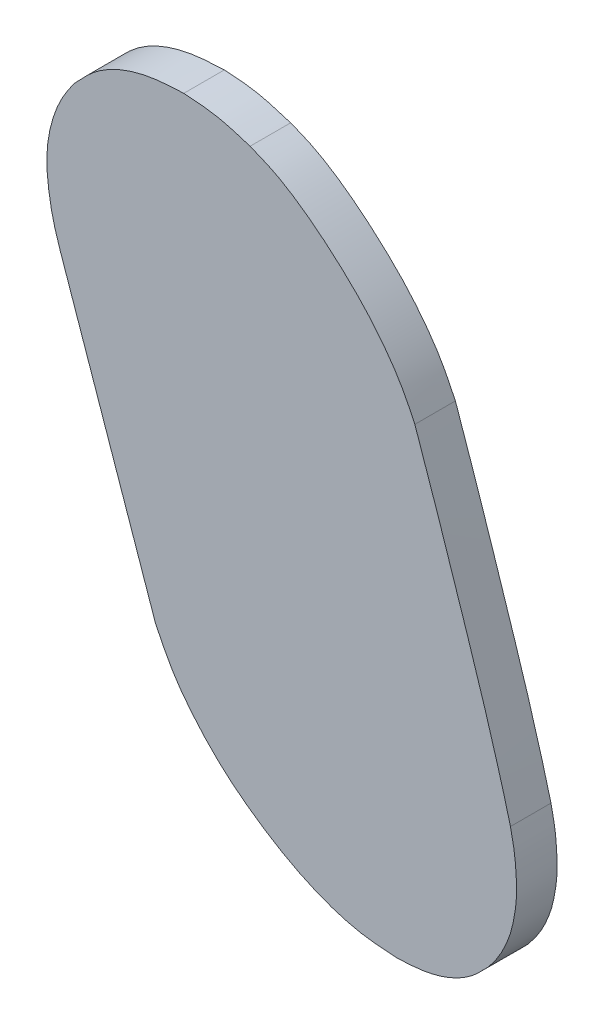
ISO-10303-21;
HEADER;
FILE_DESCRIPTION(('STEP AP214'),'2;1');
FILE_NAME('part.step','',(''),(''),'','','');
FILE_SCHEMA(('AUTOMOTIVE_DESIGN { 1 0 10303 214 1 1 1 1 }'));
ENDSEC;
DATA;
#1=APPLICATION_CONTEXT('core data for automotive mechanical design processes');
#2=APPLICATION_PROTOCOL_DEFINITION('international standard','automotive_design',2000,#1);
#3=PRODUCT_CONTEXT('',#1,'mechanical');
#4=PRODUCT('Part','Part','',(#3));
#5=PRODUCT_RELATED_PRODUCT_CATEGORY('part','',(#4));
#6=PRODUCT_DEFINITION_FORMATION('','',#4);
#7=PRODUCT_DEFINITION_CONTEXT('part definition',#1,'design');
#8=PRODUCT_DEFINITION('design','',#6,#7);
#9=PRODUCT_DEFINITION_SHAPE('','',#8);
#10=(LENGTH_UNIT() NAMED_UNIT(*) SI_UNIT(.MILLI.,.METRE.));
#11=(NAMED_UNIT(*) PLANE_ANGLE_UNIT() SI_UNIT($,.RADIAN.));
#12=(NAMED_UNIT(*) SI_UNIT($,.STERADIAN.) SOLID_ANGLE_UNIT());
#13=UNCERTAINTY_MEASURE_WITH_UNIT(LENGTH_MEASURE(1.E-05),#10,'distance_accuracy_value','');
#14=(GEOMETRIC_REPRESENTATION_CONTEXT(3) GLOBAL_UNCERTAINTY_ASSIGNED_CONTEXT((#13)) GLOBAL_UNIT_ASSIGNED_CONTEXT((#10,
#11,#12)) REPRESENTATION_CONTEXT('',''));
#15=CARTESIAN_POINT('',(0.,0.,0.));
#16=DIRECTION('',(0.,0.,1.));
#17=DIRECTION('',(1.,0.,0.));
#18=AXIS2_PLACEMENT_3D('',#15,#16,#17);
#19=CARTESIAN_POINT('',(0.,0.,0.8));
#20=DIRECTION('',(0.,0.,1.));
#21=DIRECTION('',(1.,0.,0.));
#22=AXIS2_PLACEMENT_3D('',#19,#20,#21);
#23=PLANE('',#22);
#24=CARTESIAN_POINT('',(422.428847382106,216.192013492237,0.8));
#25=CARTESIAN_POINT('',(422.469823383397,216.17574645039,0.8));
#26=CARTESIAN_POINT('',(422.510805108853,216.159478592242,0.8));
#27=CARTESIAN_POINT('',(422.592599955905,216.126421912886,0.8));
#28=CARTESIAN_POINT('',(422.633412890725,216.109632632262,0.8));
#29=CARTESIAN_POINT('',(422.714441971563,216.075115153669,0.8));
#30=CARTESIAN_POINT('',(422.754659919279,216.057391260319,0.8));
#31=CARTESIAN_POINT('',(422.814464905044,216.029696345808,0.8));
#32=CARTESIAN_POINT('',(422.834309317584,216.020281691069,0.8));
#33=CARTESIAN_POINT('',(422.87378851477,216.00102279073,0.8));
#34=CARTESIAN_POINT('',(422.893423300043,215.991178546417,0.8));
#35=CARTESIAN_POINT('',(422.951962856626,215.96107311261,0.8));
#36=CARTESIAN_POINT('',(422.990560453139,215.940212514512,0.8));
#37=CARTESIAN_POINT('',(423.066995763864,215.897128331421,0.8));
#38=CARTESIAN_POINT('',(423.104833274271,215.874904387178,0.8));
#39=CARTESIAN_POINT('',(423.179795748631,215.829326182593,0.8));
#40=CARTESIAN_POINT('',(423.216921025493,215.805972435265,0.8));
#41=CARTESIAN_POINT('',(423.290579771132,215.758347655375,0.8));
#42=CARTESIAN_POINT('',(423.327113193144,215.734076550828,0.8));
#43=CARTESIAN_POINT('',(423.435984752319,215.660006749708,0.8));
#44=CARTESIAN_POINT('',(423.507507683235,215.609005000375,0.8));
#45=CARTESIAN_POINT('',(423.648527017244,215.50423777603,0.8));
#46=CARTESIAN_POINT('',(423.718022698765,215.45047133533,0.8));
#47=CARTESIAN_POINT('',(423.841580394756,215.351527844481,0.8));
#48=CARTESIAN_POINT('',(423.895971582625,215.306760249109,0.8));
#49=CARTESIAN_POINT('',(424.003580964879,215.215897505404,0.8));
#50=CARTESIAN_POINT('',(424.056799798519,215.169803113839,0.8));
#51=CARTESIAN_POINT('',(424.162150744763,215.076402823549,0.8));
#52=CARTESIAN_POINT('',(424.214282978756,215.029097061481,0.8));
#53=CARTESIAN_POINT('',(424.317514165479,214.933366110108,0.8));
#54=CARTESIAN_POINT('',(424.368613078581,214.884940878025,0.8));
#55=CARTESIAN_POINT('',(424.469538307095,214.786766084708,0.8));
#56=CARTESIAN_POINT('',(424.519364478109,214.737016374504,0.8));
#57=CARTESIAN_POINT('',(424.617502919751,214.636017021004,0.8));
#58=CARTESIAN_POINT('',(424.665814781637,214.584766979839,0.8));
#59=CARTESIAN_POINT('',(424.779167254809,214.460293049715,0.8));
#60=CARTESIAN_POINT('',(424.843372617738,214.386304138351,0.8));
#61=CARTESIAN_POINT('',(424.968187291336,214.235348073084,0.8));
#62=CARTESIAN_POINT('',(425.028796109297,214.158380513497,0.8));
#63=CARTESIAN_POINT('',(425.146338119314,214.001725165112,0.8));
#64=CARTESIAN_POINT('',(425.203273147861,213.922038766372,0.8));
#65=CARTESIAN_POINT('',(425.285080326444,213.799956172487,0.8));
#66=CARTESIAN_POINT('',(425.311781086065,213.758783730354,0.8));
#67=CARTESIAN_POINT('',(425.363777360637,213.675566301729,0.8));
#68=CARTESIAN_POINT('',(425.389073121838,213.633521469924,0.8));
#69=CARTESIAN_POINT('',(425.438043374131,213.54847018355,0.8));
#70=CARTESIAN_POINT('',(425.461717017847,213.505463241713,0.8));
#71=CARTESIAN_POINT('',(425.507760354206,213.418745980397,0.8));
#72=CARTESIAN_POINT('',(425.53012963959,213.375035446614,0.8));
#73=CARTESIAN_POINT('',(425.574024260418,213.287133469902,0.8));
#74=CARTESIAN_POINT('',(425.595548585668,213.242941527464,0.8));
#75=CARTESIAN_POINT('',(425.638143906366,213.154376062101,0.8));
#76=CARTESIAN_POINT('',(425.659215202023,213.110002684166,0.8));
#77=CARTESIAN_POINT('',(425.680283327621,213.065632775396,0.8));
#78=B_SPLINE_CURVE_WITH_KNOTS('',3,(#24,#25,#26,#27,#28,#29,#30,#31,#32,#33,#34,#35,#36,#37,#38,
#39,#40,#41,#42,#43,#44,#45,#46,#47,#48,#49,#50,#51,#52,#53,#54,#55,#56,#57,#58,#59,#60,#61,#62,
#63,#64,#65,#66,#67,#68,#69,#70,#71,#72,#73,#74,#75,#76,#77),.UNSPECIFIED.,.F.,.F.,(4,2,2,2,2,2,
2,2,2,2,2,2,2,2,2,2,2,2,2,2,2,2,2,2,2,2,4),(0.,0.13226978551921,0.264659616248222,
0.39648544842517,0.462374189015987,0.528262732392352,0.659849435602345,0.791470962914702,
0.923033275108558,1.05460593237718,1.31805598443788,1.5815986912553,1.79291237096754,
2.00410782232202,2.21527955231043,2.42645936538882,2.63766303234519,2.84892322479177,
3.14268793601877,3.43649279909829,3.73014963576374,3.87734424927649,4.02451298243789,
4.17175801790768,4.31904878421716,4.46651059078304,4.61387146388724),.UNSPECIFIED.);
#79=CARTESIAN_POINT('',(422.428847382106,216.192013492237,0.8));
#80=VERTEX_POINT('',#79);
#81=CARTESIAN_POINT('',(425.680283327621,213.065632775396,0.8));
#82=VERTEX_POINT('',#81);
#83=EDGE_CURVE('E241',#80,#82,#78,.T.);
#84=ORIENTED_EDGE('',*,*,#83,.F.);
#85=CARTESIAN_POINT('',(421.120978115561,216.442123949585,0.8));
#86=CARTESIAN_POINT('',(421.187501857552,216.437862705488,0.8));
#87=CARTESIAN_POINT('',(421.254054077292,216.433603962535,0.8));
#88=CARTESIAN_POINT('',(421.387042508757,216.423531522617,0.8));
#89=CARTESIAN_POINT('',(421.453478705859,216.417717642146,0.8));
#90=CARTESIAN_POINT('',(421.586189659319,216.402959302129,0.8));
#91=CARTESIAN_POINT('',(421.652463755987,216.39400810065,0.8));
#92=CARTESIAN_POINT('',(421.751256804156,216.37699287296,0.8));
#93=CARTESIAN_POINT('',(421.784085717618,216.370722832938,0.8));
#94=CARTESIAN_POINT('',(421.849520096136,216.357102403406,0.8));
#95=CARTESIAN_POINT('',(421.882125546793,216.349751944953,0.8));
#96=CARTESIAN_POINT('',(422.001423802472,216.321143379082,0.8));
#97=CARTESIAN_POINT('',(422.087446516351,216.297171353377,0.8));
#98=CARTESIAN_POINT('',(422.258636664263,216.246117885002,0.8));
#99=CARTESIAN_POINT('',(422.34380359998,216.219034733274,0.8));
#100=CARTESIAN_POINT('',(422.428847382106,216.192013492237,0.8));
#101=B_SPLINE_CURVE_WITH_KNOTS('',3,(#85,#86,#87,#88,#89,#90,#91,#92,#93,#94,#95,#96,#97,#98,
#99,#100),.UNSPECIFIED.,.F.,.F.,(4,2,2,2,2,2,2,4),(0.,0.200026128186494,0.400075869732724,
0.60055817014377,0.700804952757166,0.80105813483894,1.06884860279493,1.33678688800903),.UNSPECIFIED.);
#102=CARTESIAN_POINT('',(421.120978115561,216.442123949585,0.8));
#103=VERTEX_POINT('',#102);
#104=EDGE_CURVE('E234',#103,#80,#101,.T.);
#105=ORIENTED_EDGE('',*,*,#104,.F.);
#106=CARTESIAN_POINT('',(418.963775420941,215.535473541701,0.8));
#107=CARTESIAN_POINT('',(418.99434234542,215.568508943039,0.8));
#108=CARTESIAN_POINT('',(419.024913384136,215.601558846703,0.8));
#109=CARTESIAN_POINT('',(419.086769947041,215.667272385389,0.8));
#110=CARTESIAN_POINT('',(419.118058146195,215.699933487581,0.8));
#111=CARTESIAN_POINT('',(419.181808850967,215.764163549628,0.8));
#112=CARTESIAN_POINT('',(419.214272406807,215.795731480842,0.8));
#113=CARTESIAN_POINT('',(419.280347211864,215.856640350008,0.8));
#114=CARTESIAN_POINT('',(419.313933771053,215.886007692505,0.8));
#115=CARTESIAN_POINT('',(419.383079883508,215.942193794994,0.8));
#116=CARTESIAN_POINT('',(419.418635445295,215.969017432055,0.8));
#117=CARTESIAN_POINT('',(419.491516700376,216.020079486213,0.8));
#118=CARTESIAN_POINT('',(419.528841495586,216.044319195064,0.8));
#119=CARTESIAN_POINT('',(419.636727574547,216.109549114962,0.8));
#120=CARTESIAN_POINT('',(419.709049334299,216.147651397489,0.8));
#121=CARTESIAN_POINT('',(419.857317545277,216.216275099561,0.8));
#122=CARTESIAN_POINT('',(419.933270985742,216.246781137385,0.8));
#123=CARTESIAN_POINT('',(420.088306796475,216.300601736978,0.8));
#124=CARTESIAN_POINT('',(420.167407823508,216.323862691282,0.8));
#125=CARTESIAN_POINT('',(420.287323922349,216.353235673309,0.8));
#126=CARTESIAN_POINT('',(420.327487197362,216.362104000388,0.8));
#127=CARTESIAN_POINT('',(420.408171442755,216.378023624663,0.8));
#128=CARTESIAN_POINT('',(420.44869237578,216.385075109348,0.8));
#129=CARTESIAN_POINT('',(420.524361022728,216.396610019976,0.8));
#130=CARTESIAN_POINT('',(420.559475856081,216.401313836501,0.8));
#131=CARTESIAN_POINT('',(420.629836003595,216.409683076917,0.8));
#132=CARTESIAN_POINT('',(420.665081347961,216.413348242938,0.8));
#133=CARTESIAN_POINT('',(420.735661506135,216.419844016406,0.8));
#134=CARTESIAN_POINT('',(420.770996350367,216.422674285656,0.8));
#135=CARTESIAN_POINT('',(420.841300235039,216.427682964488,0.8));
#136=CARTESIAN_POINT('',(420.876268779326,216.429868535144,0.8));
#137=CARTESIAN_POINT('',(420.946211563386,216.433834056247,0.8));
#138=CARTESIAN_POINT('',(420.981185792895,216.435614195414,0.8));
#139=CARTESIAN_POINT('',(421.051099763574,216.438970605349,0.8));
#140=CARTESIAN_POINT('',(421.086039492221,216.440547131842,0.8));
#141=CARTESIAN_POINT('',(421.120978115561,216.442123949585,0.8));
#142=B_SPLINE_CURVE_WITH_KNOTS('',3,(#106,#107,#108,#109,#110,#111,#112,#113,#114,#115,#116,
#117,#118,#119,#120,#121,#122,#123,#124,#125,#126,#127,#128,#129,#130,#131,#132,#133,#134,#135,
#136,#137,#138,#139,#140,#141),.UNSPECIFIED.,.F.,.F.,(4,2,2,2,2,2,2,2,2,2,2,2,2,2,2,2,2,4),(0.,
0.135045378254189,0.270723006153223,0.406525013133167,0.540279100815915,0.673771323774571,
0.807196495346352,1.05188570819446,1.29706643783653,1.54402041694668,1.66737942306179,
1.79072569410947,1.89699296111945,2.00328658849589,2.10962321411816,2.21472989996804,
2.3197875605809,2.42471196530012),.UNSPECIFIED.);
#143=CARTESIAN_POINT('',(418.963775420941,215.535473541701,0.8));
#144=VERTEX_POINT('',#143);
#145=EDGE_CURVE('E227',#144,#103,#142,.T.);
#146=ORIENTED_EDGE('',*,*,#145,.F.);
#147=CARTESIAN_POINT('',(418.682401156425,212.534148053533,0.8));
#148=CARTESIAN_POINT('',(418.672071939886,212.565673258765,0.8));
#149=CARTESIAN_POINT('',(418.66174161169,212.597199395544,0.8));
#150=CARTESIAN_POINT('',(418.64127496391,212.660323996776,0.8));
#151=CARTESIAN_POINT('',(418.631138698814,212.691922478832,0.8));
#152=CARTESIAN_POINT('',(418.611273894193,212.755208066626,0.8));
#153=CARTESIAN_POINT('',(418.601544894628,212.78689502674,0.8));
#154=CARTESIAN_POINT('',(418.582679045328,212.850442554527,0.8));
#155=CARTESIAN_POINT('',(418.573542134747,212.882303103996,0.8));
#156=CARTESIAN_POINT('',(418.555939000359,212.946781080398,0.8));
#157=CARTESIAN_POINT('',(418.547486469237,212.979402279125,0.8));
#158=CARTESIAN_POINT('',(418.53155622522,213.044881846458,0.8));
#159=CARTESIAN_POINT('',(418.524078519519,213.077740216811,0.8));
#160=CARTESIAN_POINT('',(418.509961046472,213.143661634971,0.8));
#161=CARTESIAN_POINT('',(418.503321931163,213.176724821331,0.8));
#162=CARTESIAN_POINT('',(418.490794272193,213.242995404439,0.8));
#163=CARTESIAN_POINT('',(418.48490579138,213.276202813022,0.8));
#164=CARTESIAN_POINT('',(418.475242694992,213.333985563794,0.8));
#165=CARTESIAN_POINT('',(418.471319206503,213.358536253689,0.8));
#166=CARTESIAN_POINT('',(418.463775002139,213.407684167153,0.8));
#167=CARTESIAN_POINT('',(418.460154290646,213.432281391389,0.8));
#168=CARTESIAN_POINT('',(418.449791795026,213.50614451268,0.8));
#169=CARTESIAN_POINT('',(418.443549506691,213.555482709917,0.8));
#170=CARTESIAN_POINT('',(418.432908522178,213.654330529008,0.8));
#171=CARTESIAN_POINT('',(418.428508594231,213.703840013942,0.8));
#172=CARTESIAN_POINT('',(418.422079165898,213.80301485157,0.8));
#173=CARTESIAN_POINT('',(418.420049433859,213.852680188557,0.8));
#174=CARTESIAN_POINT('',(418.418655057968,213.951688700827,0.8));
#175=CARTESIAN_POINT('',(418.41927109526,214.001031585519,0.8));
#176=CARTESIAN_POINT('',(418.423243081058,214.099611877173,0.8));
#177=CARTESIAN_POINT('',(418.426599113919,214.14884928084,0.8));
#178=CARTESIAN_POINT('',(418.436225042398,214.247061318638,0.8));
#179=CARTESIAN_POINT('',(418.442496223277,214.296035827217,0.8));
#180=CARTESIAN_POINT('',(418.457833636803,214.393543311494,0.8));
#181=CARTESIAN_POINT('',(418.466899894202,214.442076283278,0.8));
#182=CARTESIAN_POINT('',(418.4856838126,214.529260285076,0.8));
#183=CARTESIAN_POINT('',(418.49493851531,214.568011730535,0.8));
#184=CARTESIAN_POINT('',(418.515135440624,214.645063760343,0.8));
#185=CARTESIAN_POINT('',(418.526077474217,214.683364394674,0.8));
#186=CARTESIAN_POINT('',(418.561431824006,214.797462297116,0.8));
#187=CARTESIAN_POINT('',(418.588382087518,214.872500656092,0.8));
#188=CARTESIAN_POINT('',(418.633940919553,214.98302059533,0.8));
#189=CARTESIAN_POINT('',(418.65000966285,215.019572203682,0.8));
#190=CARTESIAN_POINT('',(418.684000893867,215.091801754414,0.8));
#191=CARTESIAN_POINT('',(418.70192285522,215.12747994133,0.8));
#192=CARTESIAN_POINT('',(418.730263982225,215.180200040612,0.8));
#193=CARTESIAN_POINT('',(418.739952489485,215.19763798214,0.8));
#194=CARTESIAN_POINT('',(418.759841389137,215.232219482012,0.8));
#195=CARTESIAN_POINT('',(418.770041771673,215.249363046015,0.8));
#196=CARTESIAN_POINT('',(418.801323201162,215.3003777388,0.8));
#197=CARTESIAN_POINT('',(418.82308385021,215.33383161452,0.8));
#198=CARTESIAN_POINT('',(418.855000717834,215.381166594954,0.8));
#199=CARTESIAN_POINT('',(418.864714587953,215.395353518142,0.8));
#200=CARTESIAN_POINT('',(418.884292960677,215.423620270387,0.8));
#201=CARTESIAN_POINT('',(418.894157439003,215.43770011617,0.8));
#202=CARTESIAN_POINT('',(418.913955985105,215.465745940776,0.8));
#203=CARTESIAN_POINT('',(418.923889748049,215.479712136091,0.8));
#204=CARTESIAN_POINT('',(418.943807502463,215.507610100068,0.8));
#205=CARTESIAN_POINT('',(418.953791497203,215.521541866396,0.8));
#206=CARTESIAN_POINT('',(418.963775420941,215.535473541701,0.8));
#207=B_SPLINE_CURVE_WITH_KNOTS('',3,(#147,#148,#149,#150,#151,#152,#153,#154,#155,#156,#157,
#158,#159,#160,#161,#162,#163,#164,#165,#166,#167,#168,#169,#170,#171,#172,#173,#174,#175,#176,
#177,#178,#179,#180,#181,#182,#183,#184,#185,#186,#187,#188,#189,#190,#191,#192,#193,#194,#195,
#196,#197,#198,#199,#200,#201,#202,#203,#204,#205,#206),.UNSPECIFIED.,.F.,.F.,(4,2,2,2,2,2,2,2,
2,2,2,2,2,2,2,2,2,2,2,2,2,2,2,2,2,2,2,2,2,4),(0.,0.0995248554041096,0.199077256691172,
0.29851399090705,0.397940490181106,0.499021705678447,0.600103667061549,0.70126374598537,
0.802432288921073,0.877016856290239,0.951602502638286,1.10077120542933,1.24984001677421,
1.39889425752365,1.54686199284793,1.69483428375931,1.84287187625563,1.99091077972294,
2.11039499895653,2.22986584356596,2.46866961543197,2.58841734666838,2.70813115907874,
2.76797007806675,2.82780784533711,2.94748765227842,2.99906946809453,3.05064305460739,
3.1020590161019,3.1534783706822),.UNSPECIFIED.);
#208=CARTESIAN_POINT('',(418.682401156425,212.534148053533,0.8));
#209=VERTEX_POINT('',#208);
#210=EDGE_CURVE('E110',#209,#144,#207,.T.);
#211=ORIENTED_EDGE('',*,*,#210,.F.);
#212=DIRECTION('',(0.327359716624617,-0.944899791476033,0.));
#213=VECTOR('',#212,1.);
#214=CARTESIAN_POINT('',(420.563440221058,207.104666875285,0.8));
#215=LINE('',#214,#213);
#216=CARTESIAN_POINT('',(420.563440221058,207.104666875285,0.8));
#217=VERTEX_POINT('',#216);
#218=EDGE_CURVE('E106',#217,#209,#215,.F.);
#219=ORIENTED_EDGE('',*,*,#218,.F.);
#220=CARTESIAN_POINT('',(425.341592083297,203.769860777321,0.8));
#221=CARTESIAN_POINT('',(425.296291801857,203.772458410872,0.8));
#222=CARTESIAN_POINT('',(425.250988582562,203.775055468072,0.8));
#223=CARTESIAN_POINT('',(425.160384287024,203.780627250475,0.8));
#224=CARTESIAN_POINT('',(425.115083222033,203.783602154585,0.8));
#225=CARTESIAN_POINT('',(425.024576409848,203.790303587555,0.8));
#226=CARTESIAN_POINT('',(424.979370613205,203.794029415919,0.8));
#227=CARTESIAN_POINT('',(424.889071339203,203.802613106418,0.8));
#228=CARTESIAN_POINT('',(424.843977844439,203.807470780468,0.8));
#229=CARTESIAN_POINT('',(424.754042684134,203.818688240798,0.8));
#230=CARTESIAN_POINT('',(424.709200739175,203.825045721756,0.8));
#231=CARTESIAN_POINT('',(424.619820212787,203.839632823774,0.8));
#232=CARTESIAN_POINT('',(424.575281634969,203.847862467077,0.8));
#233=CARTESIAN_POINT('',(424.486777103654,203.866011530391,0.8));
#234=CARTESIAN_POINT('',(424.442809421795,203.875922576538,0.8));
#235=CARTESIAN_POINT('',(424.355261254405,203.897328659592,0.8));
#236=CARTESIAN_POINT('',(424.311680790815,203.908823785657,0.8));
#237=CARTESIAN_POINT('',(424.181542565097,203.945499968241,0.8));
#238=CARTESIAN_POINT('',(424.095596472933,203.972870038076,0.8));
#239=CARTESIAN_POINT('',(423.925414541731,204.032469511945,0.8));
#240=CARTESIAN_POINT('',(423.841179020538,204.06469980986,0.8));
#241=CARTESIAN_POINT('',(423.644332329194,204.145983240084,0.8));
#242=CARTESIAN_POINT('',(423.532489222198,204.196902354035,0.8));
#243=CARTESIAN_POINT('',(423.312196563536,204.305677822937,0.8));
#244=CARTESIAN_POINT('',(423.203748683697,204.363537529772,0.8));
#245=CARTESIAN_POINT('',(422.990177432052,204.485239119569,0.8));
#246=CARTESIAN_POINT('',(422.885056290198,204.549084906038,0.8));
#247=CARTESIAN_POINT('',(422.72959364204,204.648873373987,0.8));
#248=CARTESIAN_POINT('',(422.678009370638,204.682901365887,0.8));
#249=CARTESIAN_POINT('',(422.575635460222,204.752132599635,0.8));
#250=CARTESIAN_POINT('',(422.524845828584,204.78733585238,0.8));
#251=CARTESIAN_POINT('',(422.373848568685,204.894741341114,0.8));
#252=CARTESIAN_POINT('',(422.274936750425,204.968787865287,0.8));
#253=CARTESIAN_POINT('',(422.081687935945,205.122657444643,0.8));
#254=CARTESIAN_POINT('',(421.987350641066,205.202480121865,0.8));
#255=CARTESIAN_POINT('',(421.802078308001,205.370554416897,0.8));
#256=CARTESIAN_POINT('',(421.71129070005,205.458968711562,0.8));
#257=CARTESIAN_POINT('',(421.535330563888,205.641272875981,0.8));
#258=CARTESIAN_POINT('',(421.4501614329,205.735165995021,0.8));
#259=CARTESIAN_POINT('',(421.285070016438,205.927330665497,0.8));
#260=CARTESIAN_POINT('',(421.20514352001,206.02559859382,0.8));
#261=CARTESIAN_POINT('',(421.05360713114,206.227387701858,0.8));
#262=CARTESIAN_POINT('',(420.98193989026,206.330864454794,0.8));
#263=CARTESIAN_POINT('',(420.849603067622,206.544557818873,0.8));
#264=CARTESIAN_POINT('',(420.788937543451,206.654776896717,0.8));
#265=CARTESIAN_POINT('',(420.673261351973,206.878331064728,0.8));
#266=CARTESIAN_POINT('',(420.618255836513,206.991668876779,0.8));
#267=CARTESIAN_POINT('',(420.563440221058,207.104666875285,0.8));
#268=B_SPLINE_CURVE_WITH_KNOTS('',3,(#220,#221,#222,#223,#224,#225,#226,#227,#228,#229,#230,
#231,#232,#233,#234,#235,#236,#237,#238,#239,#240,#241,#242,#243,#244,#245,#246,#247,#248,#249,
#250,#251,#252,#253,#254,#255,#256,#257,#258,#259,#260,#261,#262,#263,#264,#265,#266,#267),
.UNSPECIFIED.,.F.,.F.,(4,2,2,2,2,2,2,2,2,2,2,2,2,2,2,2,2,2,2,2,2,2,2,4),(0.,0.136128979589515,
0.272322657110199,0.408389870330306,0.544434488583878,0.680271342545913,0.816109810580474,
0.951290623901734,1.08647904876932,1.35688191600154,1.62733457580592,1.99570344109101,
2.364250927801,2.73304043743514,2.91841667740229,3.10379463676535,3.47428069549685,
3.84474253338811,4.22462089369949,4.60472688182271,4.98452372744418,5.36150036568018,
5.73861575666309,6.11607142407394),.UNSPECIFIED.);
#269=CARTESIAN_POINT('',(425.341592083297,203.769860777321,0.8));
#270=VERTEX_POINT('',#269);
#271=EDGE_CURVE('E24',#270,#217,#268,.T.);
#272=ORIENTED_EDGE('',*,*,#271,.F.);
#273=CARTESIAN_POINT('',(427.118418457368,204.504560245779,0.8));
#274=CARTESIAN_POINT('',(427.086900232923,204.471683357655,0.8));
#275=CARTESIAN_POINT('',(427.055371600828,204.438780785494,0.8));
#276=CARTESIAN_POINT('',(426.99137025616,204.373716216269,0.8));
#277=CARTESIAN_POINT('',(426.958894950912,204.34155679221,0.8));
#278=CARTESIAN_POINT('',(426.892286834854,204.279008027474,0.8));
#279=CARTESIAN_POINT('',(426.858155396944,204.248617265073,0.8));
#280=CARTESIAN_POINT('',(426.8055406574,204.205446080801,0.8));
#281=CARTESIAN_POINT('',(426.787946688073,204.191583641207,0.8));
#282=CARTESIAN_POINT('',(426.752146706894,204.164673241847,0.8));
#283=CARTESIAN_POINT('',(426.733940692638,204.151625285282,0.8));
#284=CARTESIAN_POINT('',(426.678572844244,204.113704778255,0.8));
#285=CARTESIAN_POINT('',(426.640601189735,204.090006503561,0.8));
#286=CARTESIAN_POINT('',(426.562982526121,204.045558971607,0.8));
#287=CARTESIAN_POINT('',(426.523335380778,204.024809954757,0.8));
#288=CARTESIAN_POINT('',(426.45419863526,203.991544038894,0.8));
#289=CARTESIAN_POINT('',(426.425025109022,203.97836362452,0.8));
#290=CARTESIAN_POINT('',(426.366125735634,203.953300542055,0.8));
#291=CARTESIAN_POINT('',(426.336399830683,203.941418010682,0.8));
#292=CARTESIAN_POINT('',(426.246468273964,203.907679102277,0.8));
#293=CARTESIAN_POINT('',(426.185525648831,203.887739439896,0.8));
#294=CARTESIAN_POINT('',(426.092845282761,203.861708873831,0.8));
#295=CARTESIAN_POINT('',(426.061639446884,203.853659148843,0.8));
#296=CARTESIAN_POINT('',(425.998913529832,203.838885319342,0.8));
#297=CARTESIAN_POINT('',(425.967393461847,203.83216115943,0.8));
#298=CARTESIAN_POINT('',(425.904111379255,203.820074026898,0.8));
#299=CARTESIAN_POINT('',(425.872349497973,203.814710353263,0.8));
#300=CARTESIAN_POINT('',(425.808640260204,203.805244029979,0.8));
#301=CARTESIAN_POINT('',(425.776692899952,203.801141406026,0.8));
#302=CARTESIAN_POINT('',(425.7110861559,203.793755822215,0.8));
#303=CARTESIAN_POINT('',(425.677421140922,203.790524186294,0.8));
#304=CARTESIAN_POINT('',(425.610021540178,203.784890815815,0.8));
#305=CARTESIAN_POINT('',(425.576286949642,203.782489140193,0.8));
#306=CARTESIAN_POINT('',(425.509058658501,203.778251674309,0.8));
#307=CARTESIAN_POINT('',(425.475565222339,203.776411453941,0.8));
#308=CARTESIAN_POINT('',(425.408577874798,203.773001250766,0.8));
#309=CARTESIAN_POINT('',(425.375083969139,203.771431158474,0.8));
#310=CARTESIAN_POINT('',(425.341592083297,203.769860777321,0.8));
#311=B_SPLINE_CURVE_WITH_KNOTS('',3,(#273,#274,#275,#276,#277,#278,#279,#280,#281,#282,#283,
#284,#285,#286,#287,#288,#289,#290,#291,#292,#293,#294,#295,#296,#297,#298,#299,#300,#301,#302,
#303,#304,#305,#306,#307,#308,#309,#310),.UNSPECIFIED.,.F.,.F.,(4,2,2,2,2,2,2,2,2,2,2,2,2,2,2,2,
2,2,4),(0.,0.136675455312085,0.273768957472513,0.410750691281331,0.477926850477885,
0.545103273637,0.679224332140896,0.813356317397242,0.909361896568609,1.00537757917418,
1.1974648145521,1.29412539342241,1.3907819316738,1.48738856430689,1.58399716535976,
1.68544280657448,1.78689564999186,1.88752595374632,1.98811537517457),.UNSPECIFIED.);
#312=CARTESIAN_POINT('',(427.118418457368,204.504560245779,0.8));
#313=VERTEX_POINT('',#312);
#314=EDGE_CURVE('E93',#313,#270,#311,.T.);
#315=ORIENTED_EDGE('',*,*,#314,.F.);
#316=CARTESIAN_POINT('',(427.566533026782,207.135930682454,0.8));
#317=CARTESIAN_POINT('',(427.573545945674,207.103473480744,0.8));
#318=CARTESIAN_POINT('',(427.580556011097,207.071017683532,0.8));
#319=CARTESIAN_POINT('',(427.594323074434,207.006036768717,0.8));
#320=CARTESIAN_POINT('',(427.601079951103,206.973511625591,0.8));
#321=CARTESIAN_POINT('',(427.62057528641,206.875840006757,0.8));
#322=CARTESIAN_POINT('',(427.632554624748,206.810527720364,0.8));
#323=CARTESIAN_POINT('',(427.64742281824,206.711558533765,0.8));
#324=CARTESIAN_POINT('',(427.6518841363,206.678140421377,0.8));
#325=CARTESIAN_POINT('',(427.659835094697,206.611188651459,0.8));
#326=CARTESIAN_POINT('',(427.663324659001,206.577654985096,0.8));
#327=CARTESIAN_POINT('',(427.66954207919,206.510503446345,0.8));
#328=CARTESIAN_POINT('',(427.672269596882,206.47688554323,0.8));
#329=CARTESIAN_POINT('',(427.677150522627,206.409603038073,0.8));
#330=CARTESIAN_POINT('',(427.679303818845,206.375938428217,0.8));
#331=CARTESIAN_POINT('',(427.683808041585,206.298528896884,0.8));
#332=CARTESIAN_POINT('',(427.686025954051,206.254775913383,0.8));
#333=CARTESIAN_POINT('',(427.688974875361,206.167226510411,0.8));
#334=CARTESIAN_POINT('',(427.689706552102,206.123430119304,0.8));
#335=CARTESIAN_POINT('',(427.689076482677,206.057751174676,0.8));
#336=CARTESIAN_POINT('',(427.688578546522,206.03586108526,0.8));
#337=CARTESIAN_POINT('',(427.686884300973,205.992107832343,0.8));
#338=CARTESIAN_POINT('',(427.685688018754,205.970244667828,0.8));
#339=CARTESIAN_POINT('',(427.682598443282,205.926563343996,0.8));
#340=CARTESIAN_POINT('',(427.680704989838,205.904745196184,0.8));
#341=CARTESIAN_POINT('',(427.676325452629,205.861168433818,0.8));
#342=CARTESIAN_POINT('',(427.673839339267,205.839409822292,0.8));
#343=CARTESIAN_POINT('',(427.665669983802,205.774710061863,0.8));
#344=CARTESIAN_POINT('',(427.659237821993,205.731863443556,0.8));
#345=CARTESIAN_POINT('',(427.648592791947,205.667759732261,0.8));
#346=CARTESIAN_POINT('',(427.644877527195,205.6464155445,0.8));
#347=CARTESIAN_POINT('',(427.637146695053,205.603781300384,0.8));
#348=CARTESIAN_POINT('',(427.633131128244,205.582491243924,0.8));
#349=CARTESIAN_POINT('',(427.620478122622,205.518707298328,0.8));
#350=CARTESIAN_POINT('',(427.611239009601,205.476328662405,0.8));
#351=CARTESIAN_POINT('',(427.590453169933,205.392164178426,0.8));
#352=CARTESIAN_POINT('',(427.578908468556,205.350377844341,0.8));
#353=CARTESIAN_POINT('',(427.554515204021,205.272595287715,0.8));
#354=CARTESIAN_POINT('',(427.541983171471,205.236499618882,0.8));
#355=CARTESIAN_POINT('',(427.515081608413,205.164972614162,0.8));
#356=CARTESIAN_POINT('',(427.50071059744,205.129541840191,0.8));
#357=CARTESIAN_POINT('',(427.477989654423,205.076914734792,0.8));
#358=CARTESIAN_POINT('',(427.470224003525,205.059463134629,0.8));
#359=CARTESIAN_POINT('',(427.454345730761,205.024718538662,0.8));
#360=CARTESIAN_POINT('',(427.446233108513,205.007425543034,0.8));
#361=CARTESIAN_POINT('',(427.421343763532,204.955840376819,0.8));
#362=CARTESIAN_POINT('',(427.404004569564,204.921816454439,0.8));
#363=CARTESIAN_POINT('',(427.367119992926,204.854011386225,0.8));
#364=CARTESIAN_POINT('',(427.347534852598,204.820251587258,0.8));
#365=CARTESIAN_POINT('',(427.31649179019,204.770640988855,0.8));
#366=CARTESIAN_POINT('',(427.305862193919,204.754269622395,0.8));
#367=CARTESIAN_POINT('',(427.284059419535,204.721892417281,0.8));
#368=CARTESIAN_POINT('',(427.272886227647,204.705886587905,0.8));
#369=CARTESIAN_POINT('',(427.238729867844,204.658287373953,0.8));
#370=CARTESIAN_POINT('',(427.215129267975,204.627142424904,0.8));
#371=CARTESIAN_POINT('',(427.167152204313,204.565510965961,0.8));
#372=CARTESIAN_POINT('',(427.142776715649,204.535023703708,0.8));
#373=CARTESIAN_POINT('',(427.118418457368,204.504560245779,0.8));
#374=B_SPLINE_CURVE_WITH_KNOTS('',3,(#316,#317,#318,#319,#320,#321,#322,#323,#324,#325,#326,
#327,#328,#329,#330,#331,#332,#333,#334,#335,#336,#337,#338,#339,#340,#341,#342,#343,#344,#345,
#346,#347,#348,#349,#350,#351,#352,#353,#354,#355,#356,#357,#358,#359,#360,#361,#362,#363,#364,
#365,#366,#367,#368,#369,#370,#371,#372,#373),.UNSPECIFIED.,.F.,.F.,(4,2,2,2,2,2,2,2,2,2,2,2,2,
2,2,2,2,2,2,2,2,2,2,2,2,2,2,2,4),(0.,0.0996140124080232,0.19927513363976,0.398382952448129,
0.499508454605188,0.600641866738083,0.7018200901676,0.803018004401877,0.934436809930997,
1.06579654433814,1.13147470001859,1.19715030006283,1.26284100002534,1.32853498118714,
1.45847548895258,1.52347012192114,1.5884646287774,1.71854178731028,1.84850518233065,
1.96307082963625,2.07772929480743,2.13503014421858,2.19233105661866,2.30684944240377,
2.42385667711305,2.48240474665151,2.54095430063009,2.65816073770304,2.77522510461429),.UNSPECIFIED.);
#375=CARTESIAN_POINT('',(427.566533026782,207.135930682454,0.8));
#376=VERTEX_POINT('',#375);
#377=EDGE_CURVE('E210',#376,#313,#374,.T.);
#378=ORIENTED_EDGE('',*,*,#377,.F.);
#379=CARTESIAN_POINT('',(425.680283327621,213.065632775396,0.8));
#380=CARTESIAN_POINT('',(425.724130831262,212.939716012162,0.8));
#381=CARTESIAN_POINT('',(425.767996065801,212.813804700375,0.8));
#382=CARTESIAN_POINT('',(425.855455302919,212.561889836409,0.8));
#383=CARTESIAN_POINT('',(425.899049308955,212.435886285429,0.8));
#384=CARTESIAN_POINT('',(425.985663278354,212.183672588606,0.8));
#385=CARTESIAN_POINT('',(426.028683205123,212.057462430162,0.8));
#386=CARTESIAN_POINT('',(426.114079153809,211.804824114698,0.8));
#387=CARTESIAN_POINT('',(426.156455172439,211.678395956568,0.8));
#388=CARTESIAN_POINT('',(426.240954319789,211.425458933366,0.8));
#389=CARTESIAN_POINT('',(426.283077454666,211.298950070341,0.8));
#390=CARTESIAN_POINT('',(426.367400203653,211.045958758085,0.8));
#391=CARTESIAN_POINT('',(426.409599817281,210.919476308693,0.8));
#392=CARTESIAN_POINT('',(426.493737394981,210.666429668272,0.8));
#393=CARTESIAN_POINT('',(426.535675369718,210.539865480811,0.8));
#394=CARTESIAN_POINT('',(426.618810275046,210.286491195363,0.8));
#395=CARTESIAN_POINT('',(426.660007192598,210.159681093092,0.8));
#396=CARTESIAN_POINT('',(426.752522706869,209.872929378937,0.8));
#397=CARTESIAN_POINT('',(426.803690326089,209.712939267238,0.8));
#398=CARTESIAN_POINT('',(426.880602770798,209.473005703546,0.8));
#399=CARTESIAN_POINT('',(426.906267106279,209.393036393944,0.8));
#400=CARTESIAN_POINT('',(426.957409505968,209.233038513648,0.8));
#401=CARTESIAN_POINT('',(426.982887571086,209.153009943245,0.8));
#402=CARTESIAN_POINT('',(427.033383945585,208.992810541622,0.8));
#403=CARTESIAN_POINT('',(427.058402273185,208.912639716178,0.8));
#404=CARTESIAN_POINT('',(427.107693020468,208.752069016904,0.8));
#405=CARTESIAN_POINT('',(427.131965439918,208.671669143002,0.8));
#406=CARTESIAN_POINT('',(427.180026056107,208.510711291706,0.8));
#407=CARTESIAN_POINT('',(427.203814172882,208.430153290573,0.8));
#408=CARTESIAN_POINT('',(427.239339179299,208.30926971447,0.8));
#409=CARTESIAN_POINT('',(427.251154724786,208.268967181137,0.8));
#410=CARTESIAN_POINT('',(427.274777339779,208.188359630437,0.8));
#411=CARTESIAN_POINT('',(427.286584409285,208.148054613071,0.8));
#412=CARTESIAN_POINT('',(427.321948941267,208.027113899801,0.8));
#413=CARTESIAN_POINT('',(427.345447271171,207.946460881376,0.8));
#414=CARTESIAN_POINT('',(427.391805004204,207.784971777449,0.8));
#415=CARTESIAN_POINT('',(427.414664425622,207.704135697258,0.8));
#416=CARTESIAN_POINT('',(427.459296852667,207.54214710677,0.8));
#417=CARTESIAN_POINT('',(427.481069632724,207.460994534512,0.8));
#418=CARTESIAN_POINT('',(427.524072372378,207.298536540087,0.8));
#419=CARTESIAN_POINT('',(427.545302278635,207.217231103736,0.8));
#420=CARTESIAN_POINT('',(427.566533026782,207.135930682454,0.8));
#421=B_SPLINE_CURVE_WITH_KNOTS('',3,(#379,#380,#381,#382,#383,#384,#385,#386,#387,#388,#389,
#390,#391,#392,#393,#394,#395,#396,#397,#398,#399,#400,#401,#402,#403,#404,#405,#406,#407,#408,
#409,#410,#411,#412,#413,#414,#415,#416,#417,#418,#419,#420),.UNSPECIFIED.,.F.,.F.,(4,2,2,2,2,2,
2,2,2,2,2,2,2,2,2,2,2,2,2,2,4),(0.,0.399999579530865,0.799994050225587,1.20001389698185,
1.60003578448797,2.00004789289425,2.40005748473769,2.80005066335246,3.20005087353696,
3.70396975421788,3.9559295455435,4.20788810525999,4.4598366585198,4.71178529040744,
4.96377518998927,5.08977167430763,5.21576814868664,5.4677871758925,5.71979898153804,
5.9718628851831,6.2239514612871),.UNSPECIFIED.);
#422=EDGE_CURVE('E247',#82,#376,#421,.T.);
#423=ORIENTED_EDGE('',*,*,#422,.F.);
#424=EDGE_LOOP('',(#84,#105,#146,#211,#219,#272,#315,#378,#423));
#425=FACE_BOUND('',#424,.T.);
#426=ADVANCED_FACE('F17',(#425),#23,.T.);
#427=CARTESIAN_POINT('',(420.563440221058,207.104666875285,0.8));
#428=DIRECTION('',(-0.944899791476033,-0.327359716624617,0.));
#429=DIRECTION('',(0.327359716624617,-0.944899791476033,0.));
#430=AXIS2_PLACEMENT_3D('',#427,#428,#429);
#431=PLANE('',#430);
#432=ORIENTED_EDGE('',*,*,#218,.T.);
#433=DIRECTION('',(0.,0.,1.));
#434=VECTOR('',#433,1.);
#435=CARTESIAN_POINT('',(418.682401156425,212.534148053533,0.4));
#436=LINE('',#435,#434);
#437=CARTESIAN_POINT('',(418.682401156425,212.534148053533,0.));
#438=VERTEX_POINT('',#437);
#439=EDGE_CURVE('E317',#438,#209,#436,.T.);
#440=ORIENTED_EDGE('',*,*,#439,.F.);
#441=DIRECTION('',(0.327359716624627,-0.94489979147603,0.));
#442=VECTOR('',#441,1.);
#443=CARTESIAN_POINT('',(418.682401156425,212.534148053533,0.));
#444=LINE('',#443,#442);
#445=CARTESIAN_POINT('',(420.563440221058,207.104666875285,0.));
#446=VERTEX_POINT('',#445);
#447=EDGE_CURVE('E118',#438,#446,#444,.T.);
#448=ORIENTED_EDGE('',*,*,#447,.T.);
#449=DIRECTION('',(0.,0.,-1.));
#450=VECTOR('',#449,1.);
#451=CARTESIAN_POINT('',(420.563440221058,207.104666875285,0.4));
#452=LINE('',#451,#450);
#453=EDGE_CURVE('E102',#217,#446,#452,.T.);
#454=ORIENTED_EDGE('',*,*,#453,.F.);
#455=EDGE_LOOP('',(#432,#440,#448,#454));
#456=FACE_BOUND('',#455,.T.);
#457=ADVANCED_FACE('F116',(#456),#431,.T.);
#458=CARTESIAN_POINT('',(425.341592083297,203.769860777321,0.8));
#459=CARTESIAN_POINT('',(425.341592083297,203.769860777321,0.));
#460=CARTESIAN_POINT('',(425.11468776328,203.782869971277,0.8));
#461=CARTESIAN_POINT('',(425.11468776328,203.782869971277,0.));
#462=CARTESIAN_POINT('',(424.650435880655,203.809487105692,0.8));
#463=CARTESIAN_POINT('',(424.650435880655,203.809487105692,0.));
#464=CARTESIAN_POINT('',(423.954838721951,204.002565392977,0.8));
#465=CARTESIAN_POINT('',(423.954838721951,204.002565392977,0.));
#466=CARTESIAN_POINT('',(423.256304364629,204.317458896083,0.8));
#467=CARTESIAN_POINT('',(423.256304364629,204.317458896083,0.));
#468=CARTESIAN_POINT('',(422.567643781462,204.740684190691,0.8));
#469=CARTESIAN_POINT('',(422.567643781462,204.740684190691,0.));
#470=CARTESIAN_POINT('',(421.915966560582,205.239597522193,0.8));
#471=CARTESIAN_POINT('',(421.915966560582,205.239597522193,0.));
#472=CARTESIAN_POINT('',(421.362376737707,205.815382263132,0.8));
#473=CARTESIAN_POINT('',(421.362376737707,205.815382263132,0.));
#474=CARTESIAN_POINT('',(420.892564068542,206.426491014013,0.8));
#475=CARTESIAN_POINT('',(420.892564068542,206.426491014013,0.));
#476=CARTESIAN_POINT('',(420.672587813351,206.879762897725,0.8));
#477=CARTESIAN_POINT('',(420.672587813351,206.879762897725,0.));
#478=CARTESIAN_POINT('',(420.563440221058,207.104666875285,0.8));
#479=CARTESIAN_POINT('',(420.563440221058,207.104666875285,0.));
#480=B_SPLINE_SURFACE_WITH_KNOTS('',3,1,((#458,#459),(#460,#461),(#462,#463),(#464,#465),(#466,
#467),(#468,#469),(#470,#471),(#472,#473),(#474,#475),(#476,#477),(#478,#479)),.UNSPECIFIED.,
.F.,.F.,.F.,(4,1,1,1,1,1,1,1,4),(2,2),(0.,0.111295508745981,0.227713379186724,0.35175067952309,
0.48640442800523,0.623679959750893,0.753295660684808,0.877590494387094,1.),(0.,1.),.UNSPECIFIED.);
#481=CARTESIAN_POINT('',(420.563440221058,207.104666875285,0.));
#482=CARTESIAN_POINT('',(420.583150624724,207.064052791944,0.));
#483=CARTESIAN_POINT('',(420.602861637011,207.023437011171,0.));
#484=CARTESIAN_POINT('',(420.642554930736,206.942326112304,0.));
#485=CARTESIAN_POINT('',(420.662537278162,206.901831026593,0.));
#486=CARTESIAN_POINT('',(420.703011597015,206.821150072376,0.));
#487=CARTESIAN_POINT('',(420.723502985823,206.780963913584,0.));
#488=CARTESIAN_POINT('',(420.765279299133,206.701007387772,0.));
#489=CARTESIAN_POINT('',(420.786564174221,206.661236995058,0.));
#490=CARTESIAN_POINT('',(420.830143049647,206.582323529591,0.));
#491=CARTESIAN_POINT('',(420.852435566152,206.543179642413,0.));
#492=CARTESIAN_POINT('',(420.898334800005,206.465669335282,0.));
#493=CARTESIAN_POINT('',(420.921941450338,206.427302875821,0.));
#494=CARTESIAN_POINT('',(420.970394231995,206.35163865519,0.));
#495=CARTESIAN_POINT('',(420.995233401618,206.314336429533,0.));
#496=CARTESIAN_POINT('',(421.046078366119,206.240533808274,0.));
#497=CARTESIAN_POINT('',(421.072084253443,206.204033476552,0.));
#498=CARTESIAN_POINT('',(421.125143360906,206.131781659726,0.));
#499=CARTESIAN_POINT('',(421.152196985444,206.096030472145,0.));
#500=CARTESIAN_POINT('',(421.207206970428,206.02523358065,0.));
#501=CARTESIAN_POINT('',(421.235163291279,205.990187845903,0.));
#502=CARTESIAN_POINT('',(421.29187351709,205.92072481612,0.));
#503=CARTESIAN_POINT('',(421.320627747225,205.886307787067,0.));
#504=CARTESIAN_POINT('',(421.378799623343,205.818034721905,0.));
#505=CARTESIAN_POINT('',(421.408217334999,205.784178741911,0.));
#506=CARTESIAN_POINT('',(421.49678948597,205.684262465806,0.));
#507=CARTESIAN_POINT('',(421.5569150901,205.619056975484,0.));
#508=CARTESIAN_POINT('',(421.679939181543,205.491314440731,0.));
#509=CARTESIAN_POINT('',(421.742837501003,205.42877723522,0.));
#510=CARTESIAN_POINT('',(421.839341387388,205.337258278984,0.));
#511=CARTESIAN_POINT('',(421.871867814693,205.307133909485,0.));
#512=CARTESIAN_POINT('',(421.937656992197,205.247700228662,0.));
#513=CARTESIAN_POINT('',(421.970919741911,205.218390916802,0.));
#514=CARTESIAN_POINT('',(422.071734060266,205.131652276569,0.));
#515=CARTESIAN_POINT('',(422.140312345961,205.075411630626,0.));
#516=CARTESIAN_POINT('',(422.280107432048,204.965579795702,0.));
#517=CARTESIAN_POINT('',(422.351335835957,204.912003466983,0.));
#518=CARTESIAN_POINT('',(422.495687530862,204.807464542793,0.));
#519=CARTESIAN_POINT('',(422.568810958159,204.756502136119,0.));
#520=CARTESIAN_POINT('',(422.716720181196,204.657020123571,0.));
#521=CARTESIAN_POINT('',(422.791506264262,204.608500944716,0.));
#522=CARTESIAN_POINT('',(422.942834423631,204.514290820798,0.));
#523=CARTESIAN_POINT('',(423.019376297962,204.468599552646,0.));
#524=CARTESIAN_POINT('',(423.159485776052,204.388761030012,0.));
#525=CARTESIAN_POINT('',(423.222745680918,204.354073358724,0.));
#526=CARTESIAN_POINT('',(423.350443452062,204.286932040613,0.));
#527=CARTESIAN_POINT('',(423.414881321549,204.254478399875,0.));
#528=CARTESIAN_POINT('',(423.544957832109,204.192021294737,0.));
#529=CARTESIAN_POINT('',(423.610596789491,204.162018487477,0.));
#530=CARTESIAN_POINT('',(423.743046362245,204.104714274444,0.));
#531=CARTESIAN_POINT('',(423.809856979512,204.077412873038,0.));
#532=CARTESIAN_POINT('',(423.944159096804,204.025901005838,0.));
#533=CARTESIAN_POINT('',(424.011643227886,204.001671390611,0.));
#534=CARTESIAN_POINT('',(424.147694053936,203.956434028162,0.));
#535=CARTESIAN_POINT('',(424.216260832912,203.935426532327,0.));
#536=CARTESIAN_POINT('',(424.354339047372,203.897171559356,0.));
#537=CARTESIAN_POINT('',(424.423848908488,203.879918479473,0.));
#538=CARTESIAN_POINT('',(424.528782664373,203.857211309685,0.));
#539=CARTESIAN_POINT('',(424.563867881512,203.850171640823,0.));
#540=CARTESIAN_POINT('',(424.634247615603,203.837234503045,0.));
#541=CARTESIAN_POINT('',(424.669542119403,203.83133696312,0.));
#542=CARTESIAN_POINT('',(424.739962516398,203.820714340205,0.));
#543=CARTESIAN_POINT('',(424.775086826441,203.815978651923,0.));
#544=CARTESIAN_POINT('',(424.845451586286,203.807403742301,0.));
#545=CARTESIAN_POINT('',(424.880692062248,203.803564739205,0.));
#546=CARTESIAN_POINT('',(424.951255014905,203.796610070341,0.));
#547=CARTESIAN_POINT('',(424.986577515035,203.793494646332,0.));
#548=CARTESIAN_POINT('',(425.057422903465,203.787792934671,0.));
#549=CARTESIAN_POINT('',(425.092945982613,203.785209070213,0.));
#550=CARTESIAN_POINT('',(425.164002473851,203.780406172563,0.));
#551=CARTESIAN_POINT('',(425.199535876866,203.778187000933,0.));
#552=CARTESIAN_POINT('',(425.270577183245,203.773932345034,0.));
#553=CARTESIAN_POINT('',(425.306085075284,203.771896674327,0.));
#554=CARTESIAN_POINT('',(425.341592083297,203.769860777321,0.));
#555=B_SPLINE_CURVE_WITH_KNOTS('',3,(#481,#482,#483,#484,#485,#486,#487,#488,#489,#490,#491,
#492,#493,#494,#495,#496,#497,#498,#499,#500,#501,#502,#503,#504,#505,#506,#507,#508,#509,#510,
#511,#512,#513,#514,#515,#516,#517,#518,#519,#520,#521,#522,#523,#524,#525,#526,#527,#528,#529,
#530,#531,#532,#533,#534,#535,#536,#537,#538,#539,#540,#541,#542,#543,#544,#545,#546,#547,#548,
#549,#550,#551,#552,#553,#554),.UNSPECIFIED.,.F.,.F.,(4,2,2,2,2,2,2,2,2,2,2,2,2,2,2,2,2,2,2,2,2,
2,2,2,2,2,2,2,2,2,2,2,2,2,2,2,4),(0.,0.135435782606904,0.270905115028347,0.406225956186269,
0.541538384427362,0.676657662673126,0.811770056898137,0.946190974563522,1.0806225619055,
1.21510656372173,1.34958467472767,1.48411841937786,1.61866553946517,1.88467275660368,
2.15066389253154,2.28365205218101,2.41664012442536,2.68261359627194,2.94993405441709,
3.21727379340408,3.48466009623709,3.75201579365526,3.96841425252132,4.18481330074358,
4.4012701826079,4.61772741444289,4.83276090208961,5.0478111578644,5.2625382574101,
5.36987638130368,5.47720782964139,5.58351970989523,5.6898574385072,5.79623064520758,
5.90307851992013,6.00988574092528,6.11658319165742),.UNSPECIFIED.);
#556=CARTESIAN_POINT('',(425.341592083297,203.769860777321,0.));
#557=VERTEX_POINT('',#556);
#558=EDGE_CURVE('E181',#446,#557,#555,.T.);
#559=DIRECTION('',(0.,0.,-1.));
#560=VECTOR('',#559,1.);
#561=CARTESIAN_POINT('',(425.341592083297,203.769860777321,0.4));
#562=LINE('',#561,#560);
#563=EDGE_CURVE('E104',#270,#557,#562,.T.);
#564=ORIENTED_EDGE('',*,*,#271,.T.);
#565=ORIENTED_EDGE('',*,*,#453,.T.);
#566=ORIENTED_EDGE('',*,*,#558,.T.);
#567=ORIENTED_EDGE('',*,*,#563,.F.);
#568=EDGE_LOOP('',(#564,#565,#566,#567));
#569=FACE_BOUND('',#568,.T.);
#570=ADVANCED_FACE('F99',(#569),#480,.T.);
#571=CARTESIAN_POINT('',(427.118418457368,204.504560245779,0.8));
#572=CARTESIAN_POINT('',(427.118418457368,204.504560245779,0.));
#573=CARTESIAN_POINT('',(427.008998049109,204.390394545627,0.8));
#574=CARTESIAN_POINT('',(427.008998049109,204.390394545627,0.));
#575=CARTESIAN_POINT('',(426.790310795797,204.162223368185,0.8));
#576=CARTESIAN_POINT('',(426.790310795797,204.162223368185,0.));
#577=CARTESIAN_POINT('',(426.36062429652,203.932176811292,0.8));
#578=CARTESIAN_POINT('',(426.36062429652,203.932176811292,0.));
#579=CARTESIAN_POINT('',(425.871189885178,203.794689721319,0.8));
#580=CARTESIAN_POINT('',(425.871189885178,203.794689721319,0.));
#581=CARTESIAN_POINT('',(425.523219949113,203.77837597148,0.8));
#582=CARTESIAN_POINT('',(425.523219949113,203.77837597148,0.));
#583=CARTESIAN_POINT('',(425.341592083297,203.769860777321,0.8));
#584=CARTESIAN_POINT('',(425.341592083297,203.769860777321,0.));
#585=B_SPLINE_SURFACE_WITH_KNOTS('',3,1,((#571,#572),(#573,#574),(#575,#576),(#577,#578),(#579,
#580),(#581,#582),(#583,#584)),.UNSPECIFIED.,.F.,.F.,.F.,(4,1,1,1,4),(2,2),(0.,
0.237691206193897,0.475048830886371,0.725994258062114,1.),(0.,1.),.UNSPECIFIED.);
#586=CARTESIAN_POINT('',(425.341592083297,203.769860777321,0.));
#587=CARTESIAN_POINT('',(425.38904366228,203.772084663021,0.));
#588=CARTESIAN_POINT('',(425.436506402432,203.774309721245,0.));
#589=CARTESIAN_POINT('',(425.531483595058,203.779532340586,0.));
#590=CARTESIAN_POINT('',(425.578997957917,203.782531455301,0.));
#591=CARTESIAN_POINT('',(425.674408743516,203.790108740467,0.));
#592=CARTESIAN_POINT('',(425.722304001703,203.794703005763,0.));
#593=CARTESIAN_POINT('',(425.817767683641,203.806300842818,0.));
#594=CARTESIAN_POINT('',(425.865336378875,203.813302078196,0.));
#595=CARTESIAN_POINT('',(425.974676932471,203.832996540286,0.));
#596=CARTESIAN_POINT('',(426.03625615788,203.846783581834,0.));
#597=CARTESIAN_POINT('',(426.158155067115,203.8794337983,0.));
#598=CARTESIAN_POINT('',(426.21847270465,203.89830462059,0.));
#599=CARTESIAN_POINT('',(426.307402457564,203.930304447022,0.));
#600=CARTESIAN_POINT('',(426.336702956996,203.941547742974,0.));
#601=CARTESIAN_POINT('',(426.394802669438,203.965261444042,0.));
#602=CARTESIAN_POINT('',(426.423601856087,203.977731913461,0.));
#603=CARTESIAN_POINT('',(426.508991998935,204.017055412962,0.));
#604=CARTESIAN_POINT('',(426.564712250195,204.045868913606,0.));
#605=CARTESIAN_POINT('',(426.650089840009,204.096032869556,0.));
#606=CARTESIAN_POINT('',(426.680888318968,204.115454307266,0.));
#607=CARTESIAN_POINT('',(426.726039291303,204.146148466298,0.));
#608=CARTESIAN_POINT('',(426.740920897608,204.156644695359,0.));
#609=CARTESIAN_POINT('',(426.770288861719,204.178175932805,0.));
#610=CARTESIAN_POINT('',(426.784775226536,204.189210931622,0.));
#611=CARTESIAN_POINT('',(426.827698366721,204.22310437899,0.));
#612=CARTESIAN_POINT('',(426.855543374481,204.246713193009,0.));
#613=CARTESIAN_POINT('',(426.910321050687,204.29564046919,0.));
#614=CARTESIAN_POINT('',(426.937237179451,204.320977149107,0.));
#615=CARTESIAN_POINT('',(426.990148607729,204.372532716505,0.));
#616=CARTESIAN_POINT('',(427.016144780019,204.398750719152,0.));
#617=CARTESIAN_POINT('',(427.067566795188,204.451504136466,0.));
#618=CARTESIAN_POINT('',(427.092994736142,204.478037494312,0.));
#619=CARTESIAN_POINT('',(427.118418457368,204.504560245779,0.));
#620=B_SPLINE_CURVE_WITH_KNOTS('',3,(#586,#587,#588,#589,#590,#591,#592,#593,#594,#595,#596,
#597,#598,#599,#600,#601,#602,#603,#604,#605,#606,#607,#608,#609,#610,#611,#612,#613,#614,#615,
#616,#617,#618,#619),.UNSPECIFIED.,.F.,.F.,(4,2,2,2,2,2,2,2,2,2,2,2,2,2,2,2,4),(0.,
0.142529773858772,0.285347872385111,0.429651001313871,0.573814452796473,0.762896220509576,
0.952264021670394,1.04638904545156,1.14051900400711,1.32834525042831,1.43750037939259,
1.49212163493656,1.54674192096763,1.65618470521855,1.76704847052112,1.87780407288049,
1.98804191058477),.UNSPECIFIED.);
#621=CARTESIAN_POINT('',(427.118418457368,204.504560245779,0.));
#622=VERTEX_POINT('',#621);
#623=EDGE_CURVE('E174',#557,#622,#620,.T.);
#624=DIRECTION('',(0.,0.,-1.));
#625=VECTOR('',#624,1.);
#626=CARTESIAN_POINT('',(427.118418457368,204.504560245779,0.4));
#627=LINE('',#626,#625);
#628=EDGE_CURVE('E253',#313,#622,#627,.T.);
#629=ORIENTED_EDGE('',*,*,#314,.T.);
#630=ORIENTED_EDGE('',*,*,#563,.T.);
#631=ORIENTED_EDGE('',*,*,#623,.T.);
#632=ORIENTED_EDGE('',*,*,#628,.F.);
#633=EDGE_LOOP('',(#629,#630,#631,#632));
#634=FACE_BOUND('',#633,.T.);
#635=ADVANCED_FACE('F187',(#634),#585,.T.);
#636=CARTESIAN_POINT('',(427.566533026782,207.135930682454,0.8));
#637=CARTESIAN_POINT('',(427.566533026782,207.135930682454,0.));
#638=CARTESIAN_POINT('',(427.595698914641,207.000911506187,0.8));
#639=CARTESIAN_POINT('',(427.595698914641,207.000911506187,0.));
#640=CARTESIAN_POINT('',(427.652158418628,206.7395405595,0.8));
#641=CARTESIAN_POINT('',(427.652158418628,206.7395405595,0.));
#642=CARTESIAN_POINT('',(427.683258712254,206.353417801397,0.8));
#643=CARTESIAN_POINT('',(427.683258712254,206.353417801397,0.));
#644=CARTESIAN_POINT('',(427.69705444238,205.989954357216,0.8));
#645=CARTESIAN_POINT('',(427.69705444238,205.989954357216,0.));
#646=CARTESIAN_POINT('',(427.649349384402,205.649976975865,0.8));
#647=CARTESIAN_POINT('',(427.649349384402,205.649976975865,0.));
#648=CARTESIAN_POINT('',(427.581223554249,205.32772512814,0.8));
#649=CARTESIAN_POINT('',(427.581223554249,205.32772512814,0.));
#650=CARTESIAN_POINT('',(427.462931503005,205.029520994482,0.8));
#651=CARTESIAN_POINT('',(427.462931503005,205.029520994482,0.));
#652=CARTESIAN_POINT('',(427.314496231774,204.749802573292,0.8));
#653=CARTESIAN_POINT('',(427.314496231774,204.749802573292,0.));
#654=CARTESIAN_POINT('',(427.183627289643,204.586119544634,0.8));
#655=CARTESIAN_POINT('',(427.183627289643,204.586119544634,0.));
#656=CARTESIAN_POINT('',(427.118418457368,204.504560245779,0.8));
#657=CARTESIAN_POINT('',(427.118418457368,204.504560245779,0.));
#658=B_SPLINE_SURFACE_WITH_KNOTS('',3,1,((#636,#637),(#638,#639),(#640,#641),(#642,#643),(#644,
#645),(#646,#647),(#648,#649),(#650,#651),(#652,#653),(#654,#655),(#656,#657)),.UNSPECIFIED.,
.F.,.F.,.F.,(4,1,1,1,1,1,1,1,4),(2,2),(0.,0.149202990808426,0.288828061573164,0.41845401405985,
0.54147389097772,0.659037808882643,0.773807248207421,0.887293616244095,1.),(0.,1.),.UNSPECIFIED.);
#659=CARTESIAN_POINT('',(427.118418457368,204.504560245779,0.));
#660=CARTESIAN_POINT('',(427.139677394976,204.531148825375,0.));
#661=CARTESIAN_POINT('',(427.160942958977,204.557746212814,0.));
#662=CARTESIAN_POINT('',(427.202975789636,204.611396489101,0.));
#663=CARTESIAN_POINT('',(427.223742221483,204.638450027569,0.));
#664=CARTESIAN_POINT('',(427.264212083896,204.693392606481,0.));
#665=CARTESIAN_POINT('',(427.283914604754,204.721282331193,0.));
#666=CARTESIAN_POINT('',(427.321576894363,204.778188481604,0.));
#667=CARTESIAN_POINT('',(427.339537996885,204.807204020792,0.));
#668=CARTESIAN_POINT('',(427.373632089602,204.865705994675,0.));
#669=CARTESIAN_POINT('',(427.389788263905,204.895179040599,0.));
#670=CARTESIAN_POINT('',(427.420786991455,204.954825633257,0.));
#671=CARTESIAN_POINT('',(427.435628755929,204.984999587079,0.));
#672=CARTESIAN_POINT('',(427.464217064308,205.04582563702,0.));
#673=CARTESIAN_POINT('',(427.477964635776,205.076477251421,0.));
#674=CARTESIAN_POINT('',(427.504239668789,205.138290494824,0.));
#675=CARTESIAN_POINT('',(427.516767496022,205.169451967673,0.));
#676=CARTESIAN_POINT('',(427.541315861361,205.234728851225,0.));
#677=CARTESIAN_POINT('',(427.55322340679,205.268887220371,0.));
#678=CARTESIAN_POINT('',(427.575076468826,205.337825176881,0.));
#679=CARTESIAN_POINT('',(427.5850220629,205.372604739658,0.));
#680=CARTESIAN_POINT('',(427.612289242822,205.477659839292,0.));
#681=CARTESIAN_POINT('',(427.627020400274,205.548595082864,0.));
#682=CARTESIAN_POINT('',(427.646615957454,205.655689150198,0.));
#683=CARTESIAN_POINT('',(427.652750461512,205.69164806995,0.));
#684=CARTESIAN_POINT('',(427.663956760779,205.763732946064,0.));
#685=CARTESIAN_POINT('',(427.669028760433,205.799858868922,0.));
#686=CARTESIAN_POINT('',(427.677678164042,205.872263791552,0.));
#687=CARTESIAN_POINT('',(427.681256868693,205.908542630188,0.));
#688=CARTESIAN_POINT('',(427.685208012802,205.963061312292,0.));
#689=CARTESIAN_POINT('',(427.686288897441,205.981250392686,0.));
#690=CARTESIAN_POINT('',(427.687952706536,206.017651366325,0.));
#691=CARTESIAN_POINT('',(427.688535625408,206.035863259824,0.));
#692=CARTESIAN_POINT('',(427.689522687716,206.084566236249,0.));
#693=CARTESIAN_POINT('',(427.689541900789,206.115064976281,0.));
#694=CARTESIAN_POINT('',(427.688661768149,206.17605077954,0.));
#695=CARTESIAN_POINT('',(427.687762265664,206.206537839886,0.));
#696=CARTESIAN_POINT('',(427.68531528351,206.267540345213,0.));
#697=CARTESIAN_POINT('',(427.683766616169,206.298055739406,0.));
#698=CARTESIAN_POINT('',(427.680333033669,206.359064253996,0.));
#699=CARTESIAN_POINT('',(427.678448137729,206.389557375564,0.));
#700=CARTESIAN_POINT('',(427.672146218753,206.481039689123,0.));
#701=CARTESIAN_POINT('',(427.667083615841,206.541991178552,0.));
#702=CARTESIAN_POINT('',(427.657372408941,206.632796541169,0.));
#703=CARTESIAN_POINT('',(427.653812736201,206.662765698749,0.));
#704=CARTESIAN_POINT('',(427.645826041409,206.7225877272,0.));
#705=CARTESIAN_POINT('',(427.641399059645,206.752440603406,0.));
#706=CARTESIAN_POINT('',(427.631754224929,206.811953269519,0.));
#707=CARTESIAN_POINT('',(427.626538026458,206.841613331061,0.));
#708=CARTESIAN_POINT('',(427.615534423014,206.900830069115,0.));
#709=CARTESIAN_POINT('',(427.609746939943,206.930386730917,0.));
#710=CARTESIAN_POINT('',(427.597813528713,206.98929922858,0.));
#711=CARTESIAN_POINT('',(427.59166918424,207.018655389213,0.));
#712=CARTESIAN_POINT('',(427.579193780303,207.077318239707,0.));
#713=CARTESIAN_POINT('',(427.572862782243,207.106624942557,0.));
#714=CARTESIAN_POINT('',(427.566533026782,207.135930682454,0.));
#715=B_SPLINE_CURVE_WITH_KNOTS('',3,(#659,#660,#661,#662,#663,#664,#665,#666,#667,#668,#669,
#670,#671,#672,#673,#674,#675,#676,#677,#678,#679,#680,#681,#682,#683,#684,#685,#686,#687,#688,
#689,#690,#691,#692,#693,#694,#695,#696,#697,#698,#699,#700,#701,#702,#703,#704,#705,#706,#707,
#708,#709,#710,#711,#712,#713,#714),.UNSPECIFIED.,.F.,.F.,(4,2,2,2,2,2,2,2,2,2,2,2,2,2,2,2,2,2,
2,2,2,2,2,2,2,2,2,4),(0.,0.102145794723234,0.204451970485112,0.30684428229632,0.409157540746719,
0.509951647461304,0.610805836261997,0.711564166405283,0.812292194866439,0.920761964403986,
1.02922745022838,1.24633867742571,1.3557761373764,1.46519252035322,1.5745133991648,
1.62917053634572,1.68382828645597,1.7753043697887,1.86679606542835,1.95845588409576,
2.05011046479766,2.23354166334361,2.32407079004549,2.41459571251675,2.5049334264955,
2.59528350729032,2.68525942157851,2.77520605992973),.UNSPECIFIED.);
#716=CARTESIAN_POINT('',(427.566533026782,207.135930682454,0.));
#717=VERTEX_POINT('',#716);
#718=EDGE_CURVE('E167',#622,#717,#715,.T.);
#719=DIRECTION('',(0.,0.,-1.));
#720=VECTOR('',#719,1.);
#721=CARTESIAN_POINT('',(427.566533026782,207.135930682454,0.4));
#722=LINE('',#721,#720);
#723=EDGE_CURVE('E252',#376,#717,#722,.T.);
#724=ORIENTED_EDGE('',*,*,#377,.T.);
#725=ORIENTED_EDGE('',*,*,#628,.T.);
#726=ORIENTED_EDGE('',*,*,#718,.T.);
#727=ORIENTED_EDGE('',*,*,#723,.F.);
#728=EDGE_LOOP('',(#724,#725,#726,#727));
#729=FACE_BOUND('',#728,.T.);
#730=ADVANCED_FACE('F192',(#729),#658,.T.);
#731=CARTESIAN_POINT('',(425.680283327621,213.065632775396,0.8));
#732=CARTESIAN_POINT('',(425.680283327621,213.065632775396,0.));
#733=CARTESIAN_POINT('',(425.795741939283,212.734169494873,0.8));
#734=CARTESIAN_POINT('',(425.795741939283,212.734169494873,0.));
#735=CARTESIAN_POINT('',(426.017257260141,212.098234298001,0.8));
#736=CARTESIAN_POINT('',(426.017257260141,212.098234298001,0.));
#737=CARTESIAN_POINT('',(426.323740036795,211.176180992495,0.8));
#738=CARTESIAN_POINT('',(426.323740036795,211.176180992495,0.));
#739=CARTESIAN_POINT('',(426.606603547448,210.329628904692,0.8));
#740=CARTESIAN_POINT('',(426.606603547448,210.329628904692,0.));
#741=CARTESIAN_POINT('',(426.855488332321,209.550544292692,0.8));
#742=CARTESIAN_POINT('',(426.855488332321,209.550544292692,0.));
#743=CARTESIAN_POINT('',(427.08168923,208.84706995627,0.8));
#744=CARTESIAN_POINT('',(427.08168923,208.84706995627,0.));
#745=CARTESIAN_POINT('',(427.268016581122,208.211638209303,0.8));
#746=CARTESIAN_POINT('',(427.268016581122,208.211638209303,0.));
#747=CARTESIAN_POINT('',(427.431852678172,207.651706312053,0.8));
#748=CARTESIAN_POINT('',(427.431852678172,207.651706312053,0.));
#749=CARTESIAN_POINT('',(427.523847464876,207.299400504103,0.8));
#750=CARTESIAN_POINT('',(427.523847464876,207.299400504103,0.));
#751=CARTESIAN_POINT('',(427.566533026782,207.135930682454,0.8));
#752=CARTESIAN_POINT('',(427.566533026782,207.135930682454,0.));
#753=B_SPLINE_SURFACE_WITH_KNOTS('',3,1,((#731,#732),(#733,#734),(#735,#736),(#737,#738),(#739,
#740),(#741,#742),(#743,#744),(#745,#746),(#747,#748),(#749,#750),(#751,#752)),.UNSPECIFIED.,
.F.,.F.,.F.,(4,1,1,1,1,1,1,1,4),(2,2),(0.,0.169181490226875,0.324586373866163,0.468342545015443,
0.599397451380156,0.718811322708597,0.824500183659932,0.918568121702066,1.),(0.,1.),.UNSPECIFIED.);
#754=CARTESIAN_POINT('',(427.566533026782,207.135930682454,0.));
#755=CARTESIAN_POINT('',(427.549670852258,207.200457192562,0.));
#756=CARTESIAN_POINT('',(427.532826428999,207.264989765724,0.));
#757=CARTESIAN_POINT('',(427.49886507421,207.393982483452,0.));
#758=CARTESIAN_POINT('',(427.481748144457,207.458442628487,0.));
#759=CARTESIAN_POINT('',(427.446933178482,207.587208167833,0.));
#760=CARTESIAN_POINT('',(427.429235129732,207.651513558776,0.));
#761=CARTESIAN_POINT('',(427.393219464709,207.779949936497,0.));
#762=CARTESIAN_POINT('',(427.374901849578,207.844080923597,0.));
#763=CARTESIAN_POINT('',(427.337926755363,207.972224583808,0.));
#764=CARTESIAN_POINT('',(427.319269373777,208.03623728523,0.));
#765=CARTESIAN_POINT('',(427.281864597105,208.164236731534,0.));
#766=CARTESIAN_POINT('',(427.263117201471,208.228223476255,0.));
#767=CARTESIAN_POINT('',(427.225562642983,208.356178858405,0.));
#768=CARTESIAN_POINT('',(427.206755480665,208.420147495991,0.));
#769=CARTESIAN_POINT('',(427.168909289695,208.548015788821,0.));
#770=CARTESIAN_POINT('',(427.149870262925,208.61191544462,0.));
#771=CARTESIAN_POINT('',(427.111416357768,208.739596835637,0.));
#772=CARTESIAN_POINT('',(427.092001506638,208.803378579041,0.));
#773=CARTESIAN_POINT('',(427.052714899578,208.930801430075,0.));
#774=CARTESIAN_POINT('',(427.032843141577,208.994442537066,0.));
#775=CARTESIAN_POINT('',(426.972776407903,209.185223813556,0.));
#776=CARTESIAN_POINT('',(426.932130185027,209.312221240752,0.));
#777=CARTESIAN_POINT('',(426.871092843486,209.50270293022,0.));
#778=CARTESIAN_POINT('',(426.850734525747,209.566198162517,0.));
#779=CARTESIAN_POINT('',(426.810033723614,209.693193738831,0.));
#780=CARTESIAN_POINT('',(426.789691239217,209.756694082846,0.));
#781=CARTESIAN_POINT('',(426.728581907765,209.947167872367,0.));
#782=CARTESIAN_POINT('',(426.687732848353,210.074115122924,0.));
#783=CARTESIAN_POINT('',(426.620586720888,210.280834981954,0.));
#784=CARTESIAN_POINT('',(426.594500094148,210.360675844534,0.));
#785=CARTESIAN_POINT('',(426.542054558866,210.520268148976,0.));
#786=CARTESIAN_POINT('',(426.515695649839,210.600019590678,0.));
#787=CARTESIAN_POINT('',(426.436384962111,210.839197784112,0.));
#788=CARTESIAN_POINT('',(426.383199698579,210.99854695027,0.));
#789=CARTESIAN_POINT('',(426.276966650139,211.317290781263,0.));
#790=CARTESIAN_POINT('',(426.223918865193,211.476685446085,0.));
#791=CARTESIAN_POINT('',(426.117288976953,211.795239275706,0.));
#792=CARTESIAN_POINT('',(426.063707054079,211.954398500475,0.));
#793=CARTESIAN_POINT('',(425.955417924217,212.272330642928,0.));
#794=CARTESIAN_POINT('',(425.900710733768,212.43110356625,0.));
#795=CARTESIAN_POINT('',(425.790756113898,212.748460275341,0.));
#796=CARTESIAN_POINT('',(425.735508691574,212.907044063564,0.));
#797=CARTESIAN_POINT('',(425.680283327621,213.065632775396,0.));
#798=B_SPLINE_CURVE_WITH_KNOTS('',3,(#754,#755,#756,#757,#758,#759,#760,#761,#762,#763,#764,
#765,#766,#767,#768,#769,#770,#771,#772,#773,#774,#775,#776,#777,#778,#779,#780,#781,#782,#783,
#784,#785,#786,#787,#788,#789,#790,#791,#792,#793,#794,#795,#796,#797),.UNSPECIFIED.,.F.,.F.,(4,
2,2,2,2,2,2,2,2,2,2,2,2,2,2,2,2,2,2,2,2,4),(0.,0.200082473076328,0.400163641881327,
0.600249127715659,0.800334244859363,1.00036282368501,1.20039262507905,1.40042064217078,
1.6004470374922,1.80045898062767,2.00047183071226,2.40049971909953,2.60053726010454,
2.80057476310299,3.20064647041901,3.45262935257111,3.70461268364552,4.20858393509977,
4.71255504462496,5.2163613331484,5.72016022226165,6.22395250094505),.UNSPECIFIED.);
#799=CARTESIAN_POINT('',(425.680283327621,213.065632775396,0.));
#800=VERTEX_POINT('',#799);
#801=EDGE_CURVE('E160',#717,#800,#798,.T.);
#802=DIRECTION('',(0.,0.,-1.));
#803=VECTOR('',#802,1.);
#804=CARTESIAN_POINT('',(425.680283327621,213.065632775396,0.4));
#805=LINE('',#804,#803);
#806=EDGE_CURVE('E314',#82,#800,#805,.T.);
#807=ORIENTED_EDGE('',*,*,#422,.T.);
#808=ORIENTED_EDGE('',*,*,#723,.T.);
#809=ORIENTED_EDGE('',*,*,#801,.T.);
#810=ORIENTED_EDGE('',*,*,#806,.F.);
#811=EDGE_LOOP('',(#807,#808,#809,#810));
#812=FACE_BOUND('',#811,.T.);
#813=ADVANCED_FACE('F254',(#812),#753,.T.);
#814=CARTESIAN_POINT('',(422.428847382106,216.192013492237,0.8));
#815=CARTESIAN_POINT('',(422.428847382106,216.192013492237,0.));
#816=CARTESIAN_POINT('',(422.572970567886,216.134801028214,0.8));
#817=CARTESIAN_POINT('',(422.572970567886,216.134801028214,0.));
#818=CARTESIAN_POINT('',(422.877901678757,216.013752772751,0.8));
#819=CARTESIAN_POINT('',(422.877901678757,216.013752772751,0.));
#820=CARTESIAN_POINT('',(423.324835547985,215.745853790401,0.8));
#821=CARTESIAN_POINT('',(423.324835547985,215.745853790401,0.));
#822=CARTESIAN_POINT('',(423.789823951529,215.403094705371,0.8));
#823=CARTESIAN_POINT('',(423.789823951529,215.403094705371,0.));
#824=CARTESIAN_POINT('',(424.259577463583,214.996681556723,0.8));
#825=CARTESIAN_POINT('',(424.259577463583,214.996681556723,0.));
#826=CARTESIAN_POINT('',(424.711461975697,214.550715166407,0.8));
#827=CARTESIAN_POINT('',(424.711461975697,214.550715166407,0.));
#828=CARTESIAN_POINT('',(425.104017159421,214.074221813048,0.8));
#829=CARTESIAN_POINT('',(425.104017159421,214.074221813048,0.));
#830=CARTESIAN_POINT('',(425.43416561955,213.583934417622,0.8));
#831=CARTESIAN_POINT('',(425.43416561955,213.583934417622,0.));
#832=CARTESIAN_POINT('',(425.599221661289,213.236341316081,0.8));
#833=CARTESIAN_POINT('',(425.599221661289,213.236341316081,0.));
#834=CARTESIAN_POINT('',(425.680283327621,213.065632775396,0.8));
#835=CARTESIAN_POINT('',(425.680283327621,213.065632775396,0.));
#836=B_SPLINE_SURFACE_WITH_KNOTS('',3,1,((#814,#815),(#816,#817),(#818,#819),(#820,#821),(#822,
#823),(#824,#825),(#826,#827),(#828,#829),(#830,#831),(#832,#833),(#834,#835)),.UNSPECIFIED.,
.F.,.F.,.F.,(4,1,1,1,1,1,1,1,4),(2,2),(0.,0.100722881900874,0.213106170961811,0.337611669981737,
0.476199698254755,0.616794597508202,0.750015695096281,0.877228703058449,1.),(0.,1.),.UNSPECIFIED.);
#837=CARTESIAN_POINT('',(425.680283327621,213.065632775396,0.));
#838=CARTESIAN_POINT('',(425.660950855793,213.106342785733,0.));
#839=CARTESIAN_POINT('',(425.641618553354,213.147056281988,0.));
#840=CARTESIAN_POINT('',(425.602605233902,213.228341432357,0.));
#841=CARTESIAN_POINT('',(425.582924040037,213.268913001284,0.));
#842=CARTESIAN_POINT('',(425.542899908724,213.349689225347,0.));
#843=CARTESIAN_POINT('',(425.522557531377,213.389894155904,0.));
#844=CARTESIAN_POINT('',(425.480880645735,213.469779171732,0.));
#845=CARTESIAN_POINT('',(425.459546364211,213.509459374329,0.));
#846=CARTESIAN_POINT('',(425.415541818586,213.588045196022,0.));
#847=CARTESIAN_POINT('',(425.392872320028,213.626951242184,0.));
#848=CARTESIAN_POINT('',(425.346267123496,213.703999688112,0.));
#849=CARTESIAN_POINT('',(425.322331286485,213.742142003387,0.));
#850=CARTESIAN_POINT('',(425.249007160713,213.855263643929,0.));
#851=CARTESIAN_POINT('',(425.197966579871,213.929176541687,0.));
#852=CARTESIAN_POINT('',(425.118892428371,214.038216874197,0.));
#853=CARTESIAN_POINT('',(425.09210865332,214.074267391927,0.));
#854=CARTESIAN_POINT('',(425.037774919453,214.145787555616,0.));
#855=CARTESIAN_POINT('',(425.010224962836,214.181257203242,0.));
#856=CARTESIAN_POINT('',(424.926433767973,214.286748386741,0.));
#857=CARTESIAN_POINT('',(424.869043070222,214.355863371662,0.));
#858=CARTESIAN_POINT('',(424.763108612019,214.477873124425,0.));
#859=CARTESIAN_POINT('',(424.715103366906,214.531237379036,0.));
#860=CARTESIAN_POINT('',(424.617314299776,214.636282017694,0.));
#861=CARTESIAN_POINT('',(424.567530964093,214.687962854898,0.));
#862=CARTESIAN_POINT('',(424.466479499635,214.789834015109,0.));
#863=CARTESIAN_POINT('',(424.415211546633,214.840024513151,0.));
#864=CARTESIAN_POINT('',(424.311427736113,214.939148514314,0.));
#865=CARTESIAN_POINT('',(424.258911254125,214.988081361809,0.));
#866=CARTESIAN_POINT('',(424.152806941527,215.084790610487,0.));
#867=CARTESIAN_POINT('',(424.099218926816,215.132566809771,0.));
#868=CARTESIAN_POINT('',(423.990848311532,215.226815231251,0.));
#869=CARTESIAN_POINT('',(423.936064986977,215.273286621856,0.));
#870=CARTESIAN_POINT('',(423.807717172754,215.37930443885,0.));
#871=CARTESIAN_POINT('',(423.733711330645,215.438318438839,0.));
#872=CARTESIAN_POINT('',(423.583453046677,215.553364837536,0.));
#873=CARTESIAN_POINT('',(423.507201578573,215.609398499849,0.));
#874=CARTESIAN_POINT('',(423.391004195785,215.690721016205,0.));
#875=CARTESIAN_POINT('',(423.351996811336,215.717355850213,0.));
#876=CARTESIAN_POINT('',(423.273336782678,215.769668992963,0.));
#877=CARTESIAN_POINT('',(423.233684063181,215.795347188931,0.));
#878=CARTESIAN_POINT('',(423.153648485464,215.845484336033,0.));
#879=CARTESIAN_POINT('',(423.113266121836,215.869944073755,0.));
#880=CARTESIAN_POINT('',(423.031651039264,215.917381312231,0.));
#881=CARTESIAN_POINT('',(422.990418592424,215.940359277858,0.));
#882=CARTESIAN_POINT('',(422.927841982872,215.973524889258,0.));
#883=CARTESIAN_POINT('',(422.906845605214,215.984370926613,0.));
#884=CARTESIAN_POINT('',(422.864607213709,216.005573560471,0.));
#885=CARTESIAN_POINT('',(422.843365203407,216.015930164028,0.));
#886=CARTESIAN_POINT('',(422.779290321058,216.046309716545,0.));
#887=CARTESIAN_POINT('',(422.73612601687,216.065633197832,0.));
#888=CARTESIAN_POINT('',(422.649050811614,216.103130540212,0.));
#889=CARTESIAN_POINT('',(422.605137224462,216.12129803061,0.));
#890=CARTESIAN_POINT('',(422.517095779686,216.15698246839,0.));
#891=CARTESIAN_POINT('',(422.472968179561,216.174500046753,0.));
#892=CARTESIAN_POINT('',(422.428847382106,216.192013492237,0.));
#893=B_SPLINE_CURVE_WITH_KNOTS('',3,(#837,#838,#839,#840,#841,#842,#843,#844,#845,#846,#847,
#848,#849,#850,#851,#852,#853,#854,#855,#856,#857,#858,#859,#860,#861,#862,#863,#864,#865,#866,
#867,#868,#869,#870,#871,#872,#873,#874,#875,#876,#877,#878,#879,#880,#881,#882,#883,#884,#885,
#886,#887,#888,#889,#890,#891,#892),.UNSPECIFIED.,.F.,.F.,(4,2,2,2,2,2,2,2,2,2,2,2,2,2,2,2,2,2,
2,2,2,2,2,2,2,2,2,4),(0.,0.135206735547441,0.270484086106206,0.405649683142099,
0.540784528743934,0.675842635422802,0.810915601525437,1.080238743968,1.21496610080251,
1.349693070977,1.61910549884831,1.83440188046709,2.04963981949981,2.26485237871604,
2.4801749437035,2.69553482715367,2.9110289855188,3.19493130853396,3.47871228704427,
3.62040100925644,3.76210638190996,3.90371905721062,4.04528708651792,4.11617860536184,
4.18706910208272,4.32890914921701,4.47147311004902,4.613894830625),.UNSPECIFIED.);
#894=CARTESIAN_POINT('',(422.428847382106,216.192013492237,0.));
#895=VERTEX_POINT('',#894);
#896=EDGE_CURVE('E152',#800,#895,#893,.T.);
#897=DIRECTION('',(0.,0.,-1.));
#898=VECTOR('',#897,1.);
#899=CARTESIAN_POINT('',(422.428847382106,216.192013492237,0.4));
#900=LINE('',#899,#898);
#901=EDGE_CURVE('E311',#80,#895,#900,.T.);
#902=ORIENTED_EDGE('',*,*,#83,.T.);
#903=ORIENTED_EDGE('',*,*,#806,.T.);
#904=ORIENTED_EDGE('',*,*,#896,.T.);
#905=ORIENTED_EDGE('',*,*,#901,.F.);
#906=EDGE_LOOP('',(#902,#903,#904,#905));
#907=FACE_BOUND('',#906,.T.);
#908=ADVANCED_FACE('F259',(#907),#836,.T.);
#909=CARTESIAN_POINT('',(421.120978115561,216.442123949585,0.8));
#910=CARTESIAN_POINT('',(421.120978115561,216.442123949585,0.));
#911=CARTESIAN_POINT('',(421.327340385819,216.428910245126,0.8));
#912=CARTESIAN_POINT('',(421.327340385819,216.428910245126,0.));
#913=CARTESIAN_POINT('',(421.773431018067,216.400346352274,0.8));
#914=CARTESIAN_POINT('',(421.773431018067,216.400346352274,0.));
#915=CARTESIAN_POINT('',(422.199746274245,216.264836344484,0.8));
#916=CARTESIAN_POINT('',(422.199746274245,216.264836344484,0.));
#917=CARTESIAN_POINT('',(422.428847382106,216.192013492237,0.8));
#918=CARTESIAN_POINT('',(422.428847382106,216.192013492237,0.));
#919=B_SPLINE_SURFACE_WITH_KNOTS('',3,1,((#909,#910),(#911,#912),(#913,#914),(#915,#916),(#917,
#918)),.UNSPECIFIED.,.F.,.F.,.F.,(4,1,4),(2,2),(0.,0.462601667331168,1.),(0.,1.),.UNSPECIFIED.);
#920=CARTESIAN_POINT('',(422.428847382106,216.192013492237,0.));
#921=CARTESIAN_POINT('',(422.365348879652,216.212192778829,0.));
#922=CARTESIAN_POINT('',(422.301823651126,216.232388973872,0.));
#923=CARTESIAN_POINT('',(422.174327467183,216.271520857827,0.));
#924=CARTESIAN_POINT('',(422.110356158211,216.290455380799,0.));
#925=CARTESIAN_POINT('',(422.013802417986,216.316924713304,0.));
#926=CARTESIAN_POINT('',(421.98149097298,216.325432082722,0.));
#927=CARTESIAN_POINT('',(421.916660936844,216.341618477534,0.));
#928=CARTESIAN_POINT('',(421.884142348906,216.349297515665,0.));
#929=CARTESIAN_POINT('',(421.818895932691,216.363655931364,0.));
#930=CARTESIAN_POINT('',(421.786168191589,216.370335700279,0.));
#931=CARTESIAN_POINT('',(421.720491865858,216.382489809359,0.));
#932=CARTESIAN_POINT('',(421.687543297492,216.387964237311,0.));
#933=CARTESIAN_POINT('',(421.610391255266,216.399511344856,0.));
#934=CARTESIAN_POINT('',(421.56612608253,216.405166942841,0.));
#935=CARTESIAN_POINT('',(421.477428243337,216.415076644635,0.));
#936=CARTESIAN_POINT('',(421.432995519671,216.419330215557,0.));
#937=CARTESIAN_POINT('',(421.343961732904,216.426910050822,0.));
#938=CARTESIAN_POINT('',(421.299360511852,216.430234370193,0.));
#939=CARTESIAN_POINT('',(421.210163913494,216.436412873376,0.));
#940=CARTESIAN_POINT('',(421.165568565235,216.43926746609,0.));
#941=CARTESIAN_POINT('',(421.120978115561,216.442123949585,0.));
#942=B_SPLINE_CURVE_WITH_KNOTS('',3,(#920,#921,#922,#923,#924,#925,#926,#927,#928,#929,#930,
#931,#932,#933,#934,#935,#936,#937,#938,#939,#940,#941),.UNSPECIFIED.,.F.,.F.,(4,2,2,2,2,2,2,2,
2,2,4),(0.,0.199936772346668,0.400055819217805,0.500283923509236,0.600510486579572,
0.700697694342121,0.80087760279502,0.934719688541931,1.06861258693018,1.2027836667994,
1.33683732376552),.UNSPECIFIED.);
#943=CARTESIAN_POINT('',(421.120978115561,216.442123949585,0.));
#944=VERTEX_POINT('',#943);
#945=EDGE_CURVE('E144',#895,#944,#942,.T.);
#946=DIRECTION('',(0.,0.,-1.));
#947=VECTOR('',#946,1.);
#948=CARTESIAN_POINT('',(421.120978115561,216.442123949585,0.4));
#949=LINE('',#948,#947);
#950=EDGE_CURVE('E309',#103,#944,#949,.T.);
#951=ORIENTED_EDGE('',*,*,#104,.T.);
#952=ORIENTED_EDGE('',*,*,#901,.T.);
#953=ORIENTED_EDGE('',*,*,#945,.T.);
#954=ORIENTED_EDGE('',*,*,#950,.F.);
#955=EDGE_LOOP('',(#951,#952,#953,#954));
#956=FACE_BOUND('',#955,.T.);
#957=ADVANCED_FACE('F271',(#956),#919,.T.);
#958=CARTESIAN_POINT('',(418.963775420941,215.535473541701,0.8));
#959=CARTESIAN_POINT('',(418.963775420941,215.535473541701,0.));
#960=CARTESIAN_POINT('',(419.092880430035,215.675029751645,0.8));
#961=CARTESIAN_POINT('',(419.092880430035,215.675029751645,0.));
#962=CARTESIAN_POINT('',(419.352120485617,215.955255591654,0.8));
#963=CARTESIAN_POINT('',(419.352120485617,215.955255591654,0.));
#964=CARTESIAN_POINT('',(419.867570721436,216.244714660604,0.8));
#965=CARTESIAN_POINT('',(419.867570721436,216.244714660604,0.));
#966=CARTESIAN_POINT('',(420.467832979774,216.412650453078,0.8));
#967=CARTESIAN_POINT('',(420.467832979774,216.412650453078,0.));
#968=CARTESIAN_POINT('',(420.89573191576,216.431959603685,0.8));
#969=CARTESIAN_POINT('',(420.89573191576,216.431959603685,0.));
#970=CARTESIAN_POINT('',(421.120978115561,216.442123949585,0.8));
#971=CARTESIAN_POINT('',(421.120978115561,216.442123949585,0.));
#972=B_SPLINE_SURFACE_WITH_KNOTS('',3,1,((#958,#959),(#960,#961),(#962,#963),(#964,#965),(#966,
#967),(#968,#969),(#970,#971)),.UNSPECIFIED.,.F.,.F.,.F.,(4,1,1,1,4),(2,2),(0.,
0.234389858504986,0.470649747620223,0.721349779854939,1.),(0.,1.),.UNSPECIFIED.);
#973=CARTESIAN_POINT('',(421.120978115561,216.442123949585,0.));
#974=CARTESIAN_POINT('',(421.076801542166,216.440129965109,0.));
#975=CARTESIAN_POINT('',(421.032621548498,216.438136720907,0.));
#976=CARTESIAN_POINT('',(420.944161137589,216.43373716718,0.));
#977=CARTESIAN_POINT('',(420.899880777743,216.43132973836,0.));
#978=CARTESIAN_POINT('',(420.811327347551,216.42569107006,0.));
#979=CARTESIAN_POINT('',(420.767054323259,216.42245905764,0.));
#980=CARTESIAN_POINT('',(420.678143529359,216.41471471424,0.));
#981=CARTESIAN_POINT('',(420.633506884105,216.410189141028,0.));
#982=CARTESIAN_POINT('',(420.544471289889,216.399449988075,0.));
#983=CARTESIAN_POINT('',(420.500072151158,216.393238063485,0.));
#984=CARTESIAN_POINT('',(420.411654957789,216.378712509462,0.));
#985=CARTESIAN_POINT('',(420.367636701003,216.370400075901,0.));
#986=CARTESIAN_POINT('',(420.190879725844,216.332484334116,0.));
#987=CARTESIAN_POINT('',(420.059833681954,216.293970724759,0.));
#988=CARTESIAN_POINT('',(419.869697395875,216.220944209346,0.));
#989=CARTESIAN_POINT('',(419.807526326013,216.194138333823,0.));
#990=CARTESIAN_POINT('',(419.685808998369,216.135238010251,0.));
#991=CARTESIAN_POINT('',(419.626258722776,216.103152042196,0.));
#992=CARTESIAN_POINT('',(419.530229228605,216.045201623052,0.));
#993=CARTESIAN_POINT('',(419.492784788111,216.020926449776,0.));
#994=CARTESIAN_POINT('',(419.419663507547,215.969777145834,0.));
#995=CARTESIAN_POINT('',(419.383987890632,215.942901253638,0.));
#996=CARTESIAN_POINT('',(419.314611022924,215.886588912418,0.));
#997=CARTESIAN_POINT('',(419.280913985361,215.857147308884,0.));
#998=CARTESIAN_POINT('',(419.214669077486,215.796112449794,0.));
#999=CARTESIAN_POINT('',(419.182144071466,215.764494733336,0.));
#1000=CARTESIAN_POINT('',(419.118280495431,215.700164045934,0.));
#1001=CARTESIAN_POINT('',(419.086940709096,215.667452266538,0.));
#1002=CARTESIAN_POINT('',(419.024992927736,215.601644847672,0.));
#1003=CARTESIAN_POINT('',(418.994382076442,215.568551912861,0.));
#1004=CARTESIAN_POINT('',(418.963775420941,215.535473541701,0.));
#1005=B_SPLINE_CURVE_WITH_KNOTS('',3,(#973,#974,#975,#976,#977,#978,#979,#980,#981,#982,#983,
#984,#985,#986,#987,#988,#989,#990,#991,#992,#993,#994,#995,#996,#997,#998,#999,#1000,#1001,
#1002,#1003,#1004),.UNSPECIFIED.,.F.,.F.,(4,2,2,2,2,2,2,2,2,2,2,2,2,2,2,4),(0.,
0.132670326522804,0.265704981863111,0.39886480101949,0.533439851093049,0.667883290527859,
0.802250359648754,1.20997907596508,1.41291275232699,1.61552363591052,1.74930588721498,
1.88317939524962,2.01732834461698,2.15336634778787,2.28926072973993,2.42448185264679),.UNSPECIFIED.);
#1006=CARTESIAN_POINT('',(418.963775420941,215.535473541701,0.));
#1007=VERTEX_POINT('',#1006);
#1008=EDGE_CURVE('E36',#944,#1007,#1005,.T.);
#1009=DIRECTION('',(0.,0.,-1.));
#1010=VECTOR('',#1009,1.);
#1011=CARTESIAN_POINT('',(418.963775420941,215.535473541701,0.4));
#1012=LINE('',#1011,#1010);
#1013=EDGE_CURVE('E44',#144,#1007,#1012,.T.);
#1014=ORIENTED_EDGE('',*,*,#145,.T.);
#1015=ORIENTED_EDGE('',*,*,#950,.T.);
#1016=ORIENTED_EDGE('',*,*,#1008,.T.);
#1017=ORIENTED_EDGE('',*,*,#1013,.F.);
#1018=EDGE_LOOP('',(#1014,#1015,#1016,#1017));
#1019=FACE_BOUND('',#1018,.T.);
#1020=ADVANCED_FACE('F283',(#1019),#972,.T.);
#1021=CARTESIAN_POINT('',(418.682401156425,212.534148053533,0.8));
#1022=CARTESIAN_POINT('',(418.682401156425,212.534148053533,0.));
#1023=CARTESIAN_POINT('',(418.633757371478,212.682603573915,0.8));
#1024=CARTESIAN_POINT('',(418.633757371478,212.682603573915,0.));
#1025=CARTESIAN_POINT('',(418.539879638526,212.969108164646,0.8));
#1026=CARTESIAN_POINT('',(418.539879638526,212.969108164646,0.));
#1027=CARTESIAN_POINT('',(418.460097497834,213.400036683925,0.8));
#1028=CARTESIAN_POINT('',(418.460097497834,213.400036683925,0.));
#1029=CARTESIAN_POINT('',(418.412969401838,213.809489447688,0.8));
#1030=CARTESIAN_POINT('',(418.412969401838,213.809489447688,0.));
#1031=CARTESIAN_POINT('',(418.421916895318,214.199114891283,0.8));
#1032=CARTESIAN_POINT('',(418.421916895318,214.199114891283,0.));
#1033=CARTESIAN_POINT('',(418.486691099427,214.566962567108,0.8));
#1034=CARTESIAN_POINT('',(418.486691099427,214.566962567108,0.));
#1035=CARTESIAN_POINT('',(418.596268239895,214.912444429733,0.8));
#1036=CARTESIAN_POINT('',(418.596268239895,214.912444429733,0.));
#1037=CARTESIAN_POINT('',(418.752325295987,215.240413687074,0.8));
#1038=CARTESIAN_POINT('',(418.752325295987,215.240413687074,0.));
#1039=CARTESIAN_POINT('',(418.892948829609,215.436641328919,0.8));
#1040=CARTESIAN_POINT('',(418.892948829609,215.436641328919,0.));
#1041=CARTESIAN_POINT('',(418.963775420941,215.535473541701,0.8));
#1042=CARTESIAN_POINT('',(418.963775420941,215.535473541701,0.));
#1043=B_SPLINE_SURFACE_WITH_KNOTS('',3,1,((#1021,#1022),(#1023,#1024),(#1025,#1026),(#1027,
#1028),(#1029,#1030),(#1031,#1032),(#1033,#1034),(#1035,#1036),(#1037,#1038),(#1039,#1040),
(#1041,#1042)),.UNSPECIFIED.,.F.,.F.,.F.,(4,1,1,1,1,1,1,1,4),(2,2),(0.,0.148529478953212,
0.286647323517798,0.416272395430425,0.540305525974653,0.656087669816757,0.770588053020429,
0.884454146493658,1.),(0.,1.),.UNSPECIFIED.);
#1044=CARTESIAN_POINT('',(418.963775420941,215.535473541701,0.));
#1045=CARTESIAN_POINT('',(418.944039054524,215.507937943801,0.));
#1046=CARTESIAN_POINT('',(418.924302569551,215.480395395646,0.));
#1047=CARTESIAN_POINT('',(418.885191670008,215.425006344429,0.));
#1048=CARTESIAN_POINT('',(418.865817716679,215.397159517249,0.));
#1049=CARTESIAN_POINT('',(418.827861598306,215.34096366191,0.));
#1050=CARTESIAN_POINT('',(418.809278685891,215.312615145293,0.));
#1051=CARTESIAN_POINT('',(418.773361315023,215.25515191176,0.));
#1052=CARTESIAN_POINT('',(418.756026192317,215.226037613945,0.));
#1053=CARTESIAN_POINT('',(418.723020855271,215.167305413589,0.));
#1054=CARTESIAN_POINT('',(418.707334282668,215.137696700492,0.));
#1055=CARTESIAN_POINT('',(418.677286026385,215.077806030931,0.));
#1056=CARTESIAN_POINT('',(418.662924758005,215.047523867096,0.));
#1057=CARTESIAN_POINT('',(418.635477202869,214.986381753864,0.));
#1058=CARTESIAN_POINT('',(418.622391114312,214.955521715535,0.));
#1059=CARTESIAN_POINT('',(418.597415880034,214.893319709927,0.));
#1060=CARTESIAN_POINT('',(418.585526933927,214.861977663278,0.));
#1061=CARTESIAN_POINT('',(418.546650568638,214.753312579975,0.));
#1062=CARTESIAN_POINT('',(418.522629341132,214.674895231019,0.));
#1063=CARTESIAN_POINT('',(418.491974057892,214.555938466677,0.));
#1064=CARTESIAN_POINT('',(418.482651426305,214.51606260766,0.));
#1065=CARTESIAN_POINT('',(418.46584381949,214.435921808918,0.));
#1066=CARTESIAN_POINT('',(418.458358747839,214.395656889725,0.));
#1067=CARTESIAN_POINT('',(418.445245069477,214.314467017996,0.));
#1068=CARTESIAN_POINT('',(418.439633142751,214.273539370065,0.));
#1069=CARTESIAN_POINT('',(418.430444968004,214.191455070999,0.));
#1070=CARTESIAN_POINT('',(418.426868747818,214.150298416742,0.));
#1071=CARTESIAN_POINT('',(418.421692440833,214.067857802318,0.));
#1072=CARTESIAN_POINT('',(418.420092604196,214.0265738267,0.));
#1073=CARTESIAN_POINT('',(418.418766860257,213.943977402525,0.));
#1074=CARTESIAN_POINT('',(418.419040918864,213.902664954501,0.));
#1075=CARTESIAN_POINT('',(418.421301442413,213.823421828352,0.));
#1076=CARTESIAN_POINT('',(418.42314810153,213.785486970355,0.));
#1077=CARTESIAN_POINT('',(418.428208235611,213.70971092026,0.));
#1078=CARTESIAN_POINT('',(418.43142169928,213.671869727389,0.));
#1079=CARTESIAN_POINT('',(418.442763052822,213.558449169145,0.));
#1080=CARTESIAN_POINT('',(418.45258902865,213.483044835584,0.));
#1081=CARTESIAN_POINT('',(418.475027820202,213.332615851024,0.));
#1082=CARTESIAN_POINT('',(418.487642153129,213.257591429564,0.));
#1083=CARTESIAN_POINT('',(418.509430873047,213.146113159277,0.));
#1084=CARTESIAN_POINT('',(418.517111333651,213.109370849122,0.));
#1085=CARTESIAN_POINT('',(418.533585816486,213.03613899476,0.));
#1086=CARTESIAN_POINT('',(418.542379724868,212.999649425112,0.));
#1087=CARTESIAN_POINT('',(418.561139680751,212.927043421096,0.));
#1088=CARTESIAN_POINT('',(418.571103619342,212.890926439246,0.));
#1089=CARTESIAN_POINT('',(418.591885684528,212.818933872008,0.));
#1090=CARTESIAN_POINT('',(418.60270399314,212.783058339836,0.));
#1091=CARTESIAN_POINT('',(418.624866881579,212.71162368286,0.));
#1092=CARTESIAN_POINT('',(418.636209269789,212.676063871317,0.));
#1093=CARTESIAN_POINT('',(418.659168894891,212.605051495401,0.));
#1094=CARTESIAN_POINT('',(418.670785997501,212.569598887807,0.));
#1095=CARTESIAN_POINT('',(418.682401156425,212.534148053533,0.));
#1096=B_SPLINE_CURVE_WITH_KNOTS('',3,(#1044,#1045,#1046,#1047,#1048,#1049,#1050,#1051,#1052,
#1053,#1054,#1055,#1056,#1057,#1058,#1059,#1060,#1061,#1062,#1063,#1064,#1065,#1066,#1067,#1068,
#1069,#1070,#1071,#1072,#1073,#1074,#1075,#1076,#1077,#1078,#1079,#1080,#1081,#1082,#1083,#1084,
#1085,#1086,#1087,#1088,#1089,#1090,#1091,#1092,#1093,#1094,#1095),.UNSPECIFIED.,.F.,.F.,(4,2,2,
2,2,2,2,2,2,2,2,2,2,2,2,2,2,2,2,2,2,2,2,2,2,4),(0.,0.101644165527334,0.203409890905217,
0.305077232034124,0.406690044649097,0.507173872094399,0.607689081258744,0.708219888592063,
0.808767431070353,1.0543922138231,1.17721559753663,1.30003253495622,1.42391564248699,
1.5478004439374,1.67170092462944,1.79559915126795,1.90951079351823,2.02342149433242,
2.2514586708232,2.47962023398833,2.59221430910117,2.70479688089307,2.81717955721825,
2.92958624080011,3.04155921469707,3.15347854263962),.UNSPECIFIED.);
#1097=EDGE_CURVE('E11',#1007,#438,#1096,.T.);
#1098=ORIENTED_EDGE('',*,*,#210,.T.);
#1099=ORIENTED_EDGE('',*,*,#1013,.T.);
#1100=ORIENTED_EDGE('',*,*,#1097,.T.);
#1101=ORIENTED_EDGE('',*,*,#439,.T.);
#1102=EDGE_LOOP('',(#1098,#1099,#1100,#1101));
#1103=FACE_BOUND('',#1102,.T.);
#1104=ADVANCED_FACE('F19',(#1103),#1043,.T.);
#1105=CARTESIAN_POINT('',(0.,0.,0.));
#1106=DIRECTION('',(0.,0.,1.));
#1107=DIRECTION('',(1.,0.,0.));
#1108=AXIS2_PLACEMENT_3D('',#1105,#1106,#1107);
#1109=PLANE('',#1108);
#1110=ORIENTED_EDGE('',*,*,#1008,.F.);
#1111=ORIENTED_EDGE('',*,*,#945,.F.);
#1112=ORIENTED_EDGE('',*,*,#896,.F.);
#1113=ORIENTED_EDGE('',*,*,#801,.F.);
#1114=ORIENTED_EDGE('',*,*,#718,.F.);
#1115=ORIENTED_EDGE('',*,*,#623,.F.);
#1116=ORIENTED_EDGE('',*,*,#558,.F.);
#1117=ORIENTED_EDGE('',*,*,#447,.F.);
#1118=ORIENTED_EDGE('',*,*,#1097,.F.);
#1119=EDGE_LOOP('',(#1110,#1111,#1112,#1113,#1114,#1115,#1116,#1117,#1118));
#1120=FACE_BOUND('',#1119,.T.);
#1121=ADVANCED_FACE('F133',(#1120),#1109,.F.);
#1122=CLOSED_SHELL('',(#426,#457,#570,#635,#730,#813,#908,#957,#1020,#1104,#1121));
#1123=MANIFOLD_SOLID_BREP('B1',#1122);
#1124=ADVANCED_BREP_SHAPE_REPRESENTATION('',(#18,#1123),#14);
#1125=SHAPE_DEFINITION_REPRESENTATION(#9,#1124);
ENDSEC;
END-ISO-10303-21;
